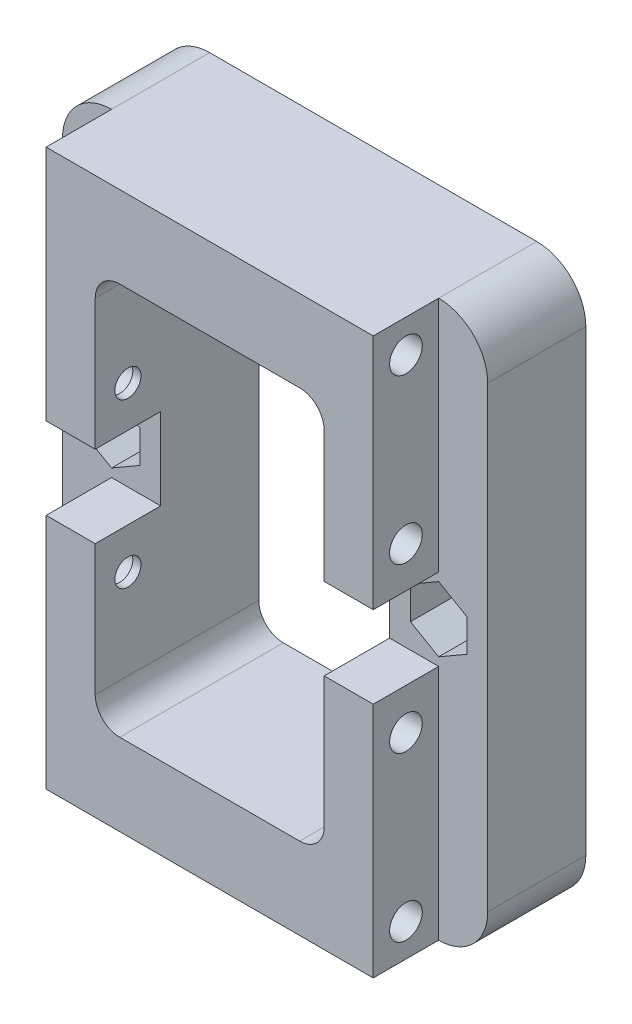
ISO-10303-21;
HEADER;
FILE_DESCRIPTION(('STEP AP214'),'2;1');
FILE_NAME('part.step','',(''),(''),'','','');
FILE_SCHEMA(('AUTOMOTIVE_DESIGN { 1 0 10303 214 1 1 1 1 }'));
ENDSEC;
DATA;
#1=APPLICATION_CONTEXT('core data for automotive mechanical design processes');
#2=APPLICATION_PROTOCOL_DEFINITION('international standard','automotive_design',2000,#1);
#3=PRODUCT_CONTEXT('',#1,'mechanical');
#4=PRODUCT('Part','Part','',(#3));
#5=PRODUCT_RELATED_PRODUCT_CATEGORY('part','',(#4));
#6=PRODUCT_DEFINITION_FORMATION('','',#4);
#7=PRODUCT_DEFINITION_CONTEXT('part definition',#1,'design');
#8=PRODUCT_DEFINITION('design','',#6,#7);
#9=PRODUCT_DEFINITION_SHAPE('','',#8);
#10=(LENGTH_UNIT() NAMED_UNIT(*) SI_UNIT(.MILLI.,.METRE.));
#11=(NAMED_UNIT(*) PLANE_ANGLE_UNIT() SI_UNIT($,.RADIAN.));
#12=(NAMED_UNIT(*) SI_UNIT($,.STERADIAN.) SOLID_ANGLE_UNIT());
#13=UNCERTAINTY_MEASURE_WITH_UNIT(LENGTH_MEASURE(1.E-05),#10,'distance_accuracy_value','');
#14=(GEOMETRIC_REPRESENTATION_CONTEXT(3) GLOBAL_UNCERTAINTY_ASSIGNED_CONTEXT((#13)) GLOBAL_UNIT_ASSIGNED_CONTEXT((#10,
#11,#12)) REPRESENTATION_CONTEXT('',''));
#15=CARTESIAN_POINT('',(0.,0.,0.));
#16=DIRECTION('',(0.,0.,1.));
#17=DIRECTION('',(1.,0.,0.));
#18=AXIS2_PLACEMENT_3D('',#15,#16,#17);
#19=CARTESIAN_POINT('',(26.,-30.,4.));
#20=DIRECTION('',(-1.,0.,0.));
#21=DIRECTION('',(0.,0.,1.));
#22=AXIS2_PLACEMENT_3D('',#19,#20,#21);
#23=CYLINDRICAL_SURFACE('',#22,1.6);
#24=CARTESIAN_POINT('',(-15.,-30.,4.));
#25=DIRECTION('',(-1.,0.,0.));
#26=DIRECTION('',(0.,0.,1.));
#27=AXIS2_PLACEMENT_3D('',#24,#25,#26);
#28=CIRCLE('',#27,1.6);
#29=CARTESIAN_POINT('',(-15.,-30.,5.6));
#30=VERTEX_POINT('',#29);
#31=EDGE_CURVE('E408',#30,#30,#28,.F.);
#32=ORIENTED_EDGE('',*,*,#31,.F.);
#33=EDGE_LOOP('',(#32));
#34=FACE_BOUND('',#33,.T.);
#35=CARTESIAN_POINT('',(15.,-30.,4.));
#36=DIRECTION('',(1.,0.,0.));
#37=DIRECTION('',(0.,0.,-1.));
#38=AXIS2_PLACEMENT_3D('',#35,#36,#37);
#39=CIRCLE('',#38,1.6);
#40=CARTESIAN_POINT('',(15.,-30.,2.4));
#41=VERTEX_POINT('',#40);
#42=EDGE_CURVE('E426',#41,#41,#39,.F.);
#43=ORIENTED_EDGE('',*,*,#42,.F.);
#44=EDGE_LOOP('',(#43));
#45=FACE_BOUND('',#44,.T.);
#46=ADVANCED_FACE('F45',(#34,#45),#23,.F.);
#47=CARTESIAN_POINT('',(26.,30.,3.99999999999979));
#48=DIRECTION('',(-1.,0.,0.));
#49=DIRECTION('',(0.,0.,1.));
#50=AXIS2_PLACEMENT_3D('',#47,#48,#49);
#51=CYLINDRICAL_SURFACE('',#50,1.6);
#52=CARTESIAN_POINT('',(-15.,30.,3.99999999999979));
#53=DIRECTION('',(-1.,0.,0.));
#54=DIRECTION('',(0.,0.,1.));
#55=AXIS2_PLACEMENT_3D('',#52,#53,#54);
#56=CIRCLE('',#55,1.6);
#57=CARTESIAN_POINT('',(-15.,30.,5.59999999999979));
#58=VERTEX_POINT('',#57);
#59=EDGE_CURVE('E399',#58,#58,#56,.F.);
#60=ORIENTED_EDGE('',*,*,#59,.F.);
#61=EDGE_LOOP('',(#60));
#62=FACE_BOUND('',#61,.T.);
#63=CARTESIAN_POINT('',(15.,30.,3.99999999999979));
#64=DIRECTION('',(1.,0.,0.));
#65=DIRECTION('',(0.,0.,-1.));
#66=AXIS2_PLACEMENT_3D('',#63,#64,#65);
#67=CIRCLE('',#66,1.6);
#68=CARTESIAN_POINT('',(15.,30.,2.39999999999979));
#69=VERTEX_POINT('',#68);
#70=EDGE_CURVE('E422',#69,#69,#67,.F.);
#71=ORIENTED_EDGE('',*,*,#70,.F.);
#72=EDGE_LOOP('',(#71));
#73=FACE_BOUND('',#72,.T.);
#74=ADVANCED_FACE('F892',(#62,#73),#51,.F.);
#75=CARTESIAN_POINT('',(26.,-10.,3.99999999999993));
#76=DIRECTION('',(-1.,0.,0.));
#77=DIRECTION('',(0.,0.,1.));
#78=AXIS2_PLACEMENT_3D('',#75,#76,#77);
#79=CYLINDRICAL_SURFACE('',#78,1.6);
#80=CARTESIAN_POINT('',(14.,-10.,3.99999999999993));
#81=DIRECTION('',(1.,0.,0.));
#82=DIRECTION('',(0.,0.,-1.));
#83=AXIS2_PLACEMENT_3D('',#80,#81,#82);
#84=CIRCLE('',#83,1.6);
#85=CARTESIAN_POINT('',(14.,-10.,2.39999999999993));
#86=VERTEX_POINT('',#85);
#87=EDGE_CURVE('E412',#86,#86,#84,.T.);
#88=ORIENTED_EDGE('',*,*,#87,.F.);
#89=EDGE_LOOP('',(#88));
#90=FACE_BOUND('',#89,.T.);
#91=CARTESIAN_POINT('',(15.,-10.,3.99999999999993));
#92=DIRECTION('',(1.,0.,0.));
#93=DIRECTION('',(0.,0.,-1.));
#94=AXIS2_PLACEMENT_3D('',#91,#92,#93);
#95=CIRCLE('',#94,1.6);
#96=CARTESIAN_POINT('',(15.,-10.,2.39999999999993));
#97=VERTEX_POINT('',#96);
#98=EDGE_CURVE('E417',#97,#97,#95,.F.);
#99=ORIENTED_EDGE('',*,*,#98,.F.);
#100=EDGE_LOOP('',(#99));
#101=FACE_BOUND('',#100,.T.);
#102=ADVANCED_FACE('F897',(#90,#101),#79,.F.);
#103=CARTESIAN_POINT('',(26.,10.,3.99999999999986));
#104=DIRECTION('',(-1.,0.,0.));
#105=DIRECTION('',(0.,0.,1.));
#106=AXIS2_PLACEMENT_3D('',#103,#104,#105);
#107=CYLINDRICAL_SURFACE('',#106,1.6);
#108=CARTESIAN_POINT('',(14.,10.,3.99999999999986));
#109=DIRECTION('',(1.,0.,0.));
#110=DIRECTION('',(0.,0.,-1.));
#111=AXIS2_PLACEMENT_3D('',#108,#109,#110);
#112=CIRCLE('',#111,1.6);
#113=CARTESIAN_POINT('',(14.,10.,2.39999999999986));
#114=VERTEX_POINT('',#113);
#115=EDGE_CURVE('E868',#114,#114,#112,.T.);
#116=ORIENTED_EDGE('',*,*,#115,.F.);
#117=EDGE_LOOP('',(#116));
#118=FACE_BOUND('',#117,.T.);
#119=CARTESIAN_POINT('',(15.,10.,3.99999999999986));
#120=DIRECTION('',(1.,0.,0.));
#121=DIRECTION('',(0.,0.,-1.));
#122=AXIS2_PLACEMENT_3D('',#119,#120,#121);
#123=CIRCLE('',#122,1.6);
#124=CARTESIAN_POINT('',(15.,10.,2.39999999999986));
#125=VERTEX_POINT('',#124);
#126=EDGE_CURVE('E413',#125,#125,#123,.F.);
#127=ORIENTED_EDGE('',*,*,#126,.F.);
#128=EDGE_LOOP('',(#127));
#129=FACE_BOUND('',#128,.T.);
#130=ADVANCED_FACE('F910',(#118,#129),#107,.F.);
#131=CARTESIAN_POINT('',(-14.,-10.,3.99999999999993));
#132=DIRECTION('',(-1.,0.,0.));
#133=DIRECTION('',(0.,-1.,0.));
#134=AXIS2_PLACEMENT_3D('',#131,#132,#133);
#135=CIRCLE('',#134,1.6);
#136=CARTESIAN_POINT('',(-14.,-11.6,3.99999999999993));
#137=VERTEX_POINT('',#136);
#138=EDGE_CURVE('E864',#137,#137,#135,.T.);
#139=ORIENTED_EDGE('',*,*,#138,.F.);
#140=EDGE_LOOP('',(#139));
#141=FACE_BOUND('',#140,.T.);
#142=CARTESIAN_POINT('',(-15.,-10.,3.99999999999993));
#143=DIRECTION('',(-1.,0.,0.));
#144=DIRECTION('',(0.,0.,1.));
#145=AXIS2_PLACEMENT_3D('',#142,#143,#144);
#146=CIRCLE('',#145,1.6);
#147=CARTESIAN_POINT('',(-15.,-10.,5.59999999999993));
#148=VERTEX_POINT('',#147);
#149=EDGE_CURVE('E404',#148,#148,#146,.F.);
#150=ORIENTED_EDGE('',*,*,#149,.F.);
#151=EDGE_LOOP('',(#150));
#152=FACE_BOUND('',#151,.T.);
#153=ADVANCED_FACE('F906',(#141,#152),#79,.F.);
#154=CARTESIAN_POINT('',(-14.,10.,3.99999999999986));
#155=DIRECTION('',(-1.,0.,0.));
#156=DIRECTION('',(0.,-1.,0.));
#157=AXIS2_PLACEMENT_3D('',#154,#155,#156);
#158=CIRCLE('',#157,1.6);
#159=CARTESIAN_POINT('',(-14.,8.4,3.99999999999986));
#160=VERTEX_POINT('',#159);
#161=EDGE_CURVE('E872',#160,#160,#158,.T.);
#162=ORIENTED_EDGE('',*,*,#161,.F.);
#163=EDGE_LOOP('',(#162));
#164=FACE_BOUND('',#163,.T.);
#165=CARTESIAN_POINT('',(-15.,10.,3.99999999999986));
#166=DIRECTION('',(-1.,0.,0.));
#167=DIRECTION('',(0.,0.,1.));
#168=AXIS2_PLACEMENT_3D('',#165,#166,#167);
#169=CIRCLE('',#168,1.6);
#170=CARTESIAN_POINT('',(-15.,10.,5.59999999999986));
#171=VERTEX_POINT('',#170);
#172=EDGE_CURVE('E395',#171,#171,#169,.F.);
#173=ORIENTED_EDGE('',*,*,#172,.F.);
#174=EDGE_LOOP('',(#173));
#175=FACE_BOUND('',#174,.T.);
#176=ADVANCED_FACE('F909',(#164,#175),#107,.F.);
#177=CARTESIAN_POINT('',(0.,0.,0.));
#178=DIRECTION('',(0.,0.,-1.));
#179=DIRECTION('',(-1.,0.,0.));
#180=AXIS2_PLACEMENT_3D('',#177,#178,#179);
#181=PLANE('',#180);
#182=DIRECTION('',(-0.866025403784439,-0.499999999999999,0.));
#183=VECTOR('',#182,1.);
#184=CARTESIAN_POINT('',(-20.,3.98371685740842,0.));
#185=LINE('',#184,#183);
#186=CARTESIAN_POINT('',(-20.,3.98371685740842,0.));
#187=VERTEX_POINT('',#186);
#188=CARTESIAN_POINT('',(-23.45,1.99185842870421,0.));
#189=VERTEX_POINT('',#188);
#190=EDGE_CURVE('E635',#187,#189,#185,.T.);
#191=ORIENTED_EDGE('',*,*,#190,.F.);
#192=DIRECTION('',(-0.866025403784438,0.500000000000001,0.));
#193=VECTOR('',#192,1.);
#194=CARTESIAN_POINT('',(-16.55,1.99185842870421,0.));
#195=LINE('',#194,#193);
#196=CARTESIAN_POINT('',(-16.55,1.99185842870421,0.));
#197=VERTEX_POINT('',#196);
#198=EDGE_CURVE('E632',#197,#187,#195,.T.);
#199=ORIENTED_EDGE('',*,*,#198,.F.);
#200=DIRECTION('',(0.,1.,0.));
#201=VECTOR('',#200,1.);
#202=CARTESIAN_POINT('',(-16.55,-1.99185842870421,0.));
#203=LINE('',#202,#201);
#204=CARTESIAN_POINT('',(-16.55,-1.99185842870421,0.));
#205=VERTEX_POINT('',#204);
#206=EDGE_CURVE('E611',#205,#197,#203,.T.);
#207=ORIENTED_EDGE('',*,*,#206,.F.);
#208=DIRECTION('',(0.866025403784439,0.5,0.));
#209=VECTOR('',#208,1.);
#210=CARTESIAN_POINT('',(-20.,-3.98371685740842,0.));
#211=LINE('',#210,#209);
#212=CARTESIAN_POINT('',(-20.,-3.98371685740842,0.));
#213=VERTEX_POINT('',#212);
#214=EDGE_CURVE('E648',#213,#205,#211,.T.);
#215=ORIENTED_EDGE('',*,*,#214,.F.);
#216=DIRECTION('',(0.866025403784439,-0.5,0.));
#217=VECTOR('',#216,1.);
#218=CARTESIAN_POINT('',(-23.45,-1.99185842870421,0.));
#219=LINE('',#218,#217);
#220=CARTESIAN_POINT('',(-23.45,-1.99185842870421,0.));
#221=VERTEX_POINT('',#220);
#222=EDGE_CURVE('E644',#221,#213,#219,.T.);
#223=ORIENTED_EDGE('',*,*,#222,.F.);
#224=DIRECTION('',(0.,-1.,0.));
#225=VECTOR('',#224,1.);
#226=CARTESIAN_POINT('',(-23.45,1.99185842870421,0.));
#227=LINE('',#226,#225);
#228=EDGE_CURVE('E640',#189,#221,#227,.T.);
#229=ORIENTED_EDGE('',*,*,#228,.F.);
#230=EDGE_LOOP('',(#191,#199,#207,#215,#223,#229));
#231=FACE_BOUND('',#230,.T.);
#232=DIRECTION('',(0.,-1.,0.));
#233=VECTOR('',#232,1.);
#234=CARTESIAN_POINT('',(-20.,5.,0.));
#235=LINE('',#234,#233);
#236=CARTESIAN_POINT('',(-20.,34.,0.));
#237=VERTEX_POINT('',#236);
#238=CARTESIAN_POINT('',(-20.,5.,0.));
#239=VERTEX_POINT('',#238);
#240=EDGE_CURVE('E576',#237,#239,#235,.T.);
#241=ORIENTED_EDGE('',*,*,#240,.F.);
#242=CARTESIAN_POINT('',(-20.,28.,0.));
#243=DIRECTION('',(0.,0.,-1.));
#244=DIRECTION('',(-1.,0.,0.));
#245=AXIS2_PLACEMENT_3D('',#242,#243,#244);
#246=CIRCLE('',#245,6.);
#247=CARTESIAN_POINT('',(-26.,28.,0.));
#248=VERTEX_POINT('',#247);
#249=EDGE_CURVE('E69',#237,#248,#246,.F.);
#250=ORIENTED_EDGE('',*,*,#249,.T.);
#251=DIRECTION('',(0.,-1.,0.));
#252=VECTOR('',#251,1.);
#253=CARTESIAN_POINT('',(-26.,-34.,0.));
#254=LINE('',#253,#252);
#255=CARTESIAN_POINT('',(-26.,-28.,0.));
#256=VERTEX_POINT('',#255);
#257=EDGE_CURVE('E369',#248,#256,#254,.T.);
#258=ORIENTED_EDGE('',*,*,#257,.T.);
#259=CARTESIAN_POINT('',(-20.,-28.,0.));
#260=DIRECTION('',(0.,0.,-1.));
#261=DIRECTION('',(-1.,0.,0.));
#262=AXIS2_PLACEMENT_3D('',#259,#260,#261);
#263=CIRCLE('',#262,6.);
#264=CARTESIAN_POINT('',(-20.,-34.,0.));
#265=VERTEX_POINT('',#264);
#266=EDGE_CURVE('E61',#256,#265,#263,.F.);
#267=ORIENTED_EDGE('',*,*,#266,.T.);
#268=DIRECTION('',(0.,-1.,0.));
#269=VECTOR('',#268,1.);
#270=CARTESIAN_POINT('',(-20.,-5.,0.));
#271=LINE('',#270,#269);
#272=CARTESIAN_POINT('',(-20.,-5.,0.));
#273=VERTEX_POINT('',#272);
#274=EDGE_CURVE('E494',#273,#265,#271,.T.);
#275=ORIENTED_EDGE('',*,*,#274,.F.);
#276=DIRECTION('',(-1.,0.,0.));
#277=VECTOR('',#276,1.);
#278=CARTESIAN_POINT('',(-14.,-5.,0.));
#279=LINE('',#278,#277);
#280=CARTESIAN_POINT('',(-14.,-5.,0.));
#281=VERTEX_POINT('',#280);
#282=EDGE_CURVE('E499',#281,#273,#279,.T.);
#283=ORIENTED_EDGE('',*,*,#282,.F.);
#284=DIRECTION('',(0.,-1.,0.));
#285=VECTOR('',#284,1.);
#286=CARTESIAN_POINT('',(-14.,21.,0.));
#287=LINE('',#286,#285);
#288=CARTESIAN_POINT('',(-14.,5.,0.));
#289=VERTEX_POINT('',#288);
#290=EDGE_CURVE('E323',#289,#281,#287,.T.);
#291=ORIENTED_EDGE('',*,*,#290,.F.);
#292=DIRECTION('',(1.,0.,0.));
#293=VECTOR('',#292,1.);
#294=CARTESIAN_POINT('',(-14.,5.,0.));
#295=LINE('',#294,#293);
#296=EDGE_CURVE('E539',#239,#289,#295,.T.);
#297=ORIENTED_EDGE('',*,*,#296,.F.);
#298=EDGE_LOOP('',(#241,#250,#258,#267,#275,#283,#291,#297));
#299=FACE_BOUND('',#298,.T.);
#300=ADVANCED_FACE('F805',(#231,#299),#181,.F.);
#301=DIRECTION('',(-0.866025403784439,-0.499999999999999,0.));
#302=VECTOR('',#301,1.);
#303=CARTESIAN_POINT('',(20.,3.98371685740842,0.));
#304=LINE('',#303,#302);
#305=CARTESIAN_POINT('',(20.,3.98371685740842,0.));
#306=VERTEX_POINT('',#305);
#307=CARTESIAN_POINT('',(16.55,1.99185842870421,0.));
#308=VERTEX_POINT('',#307);
#309=EDGE_CURVE('E707',#306,#308,#304,.T.);
#310=ORIENTED_EDGE('',*,*,#309,.F.);
#311=DIRECTION('',(-0.866025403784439,0.5,0.));
#312=VECTOR('',#311,1.);
#313=CARTESIAN_POINT('',(23.45,1.99185842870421,0.));
#314=LINE('',#313,#312);
#315=CARTESIAN_POINT('',(23.45,1.99185842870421,0.));
#316=VERTEX_POINT('',#315);
#317=EDGE_CURVE('E636',#316,#306,#314,.T.);
#318=ORIENTED_EDGE('',*,*,#317,.F.);
#319=DIRECTION('',(0.,1.,0.));
#320=VECTOR('',#319,1.);
#321=CARTESIAN_POINT('',(23.45,-1.99185842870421,0.));
#322=LINE('',#321,#320);
#323=CARTESIAN_POINT('',(23.45,-1.99185842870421,0.));
#324=VERTEX_POINT('',#323);
#325=EDGE_CURVE('E690',#324,#316,#322,.T.);
#326=ORIENTED_EDGE('',*,*,#325,.F.);
#327=DIRECTION('',(0.866025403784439,0.5,0.));
#328=VECTOR('',#327,1.);
#329=CARTESIAN_POINT('',(20.,-3.98371685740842,0.));
#330=LINE('',#329,#328);
#331=CARTESIAN_POINT('',(20.,-3.98371685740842,0.));
#332=VERTEX_POINT('',#331);
#333=EDGE_CURVE('E694',#332,#324,#330,.T.);
#334=ORIENTED_EDGE('',*,*,#333,.F.);
#335=DIRECTION('',(0.866025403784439,-0.5,0.));
#336=VECTOR('',#335,1.);
#337=CARTESIAN_POINT('',(16.55,-1.99185842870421,0.));
#338=LINE('',#337,#336);
#339=CARTESIAN_POINT('',(16.55,-1.99185842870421,0.));
#340=VERTEX_POINT('',#339);
#341=EDGE_CURVE('E699',#340,#332,#338,.T.);
#342=ORIENTED_EDGE('',*,*,#341,.F.);
#343=DIRECTION('',(0.,-1.,0.));
#344=VECTOR('',#343,1.);
#345=CARTESIAN_POINT('',(16.55,1.99185842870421,0.));
#346=LINE('',#345,#344);
#347=EDGE_CURVE('E703',#308,#340,#346,.T.);
#348=ORIENTED_EDGE('',*,*,#347,.F.);
#349=EDGE_LOOP('',(#310,#318,#326,#334,#342,#348));
#350=FACE_BOUND('',#349,.T.);
#351=DIRECTION('',(0.,1.,0.));
#352=VECTOR('',#351,1.);
#353=CARTESIAN_POINT('',(26.,-34.,0.));
#354=LINE('',#353,#352);
#355=CARTESIAN_POINT('',(26.,-28.,0.));
#356=VERTEX_POINT('',#355);
#357=CARTESIAN_POINT('',(26.,28.,0.));
#358=VERTEX_POINT('',#357);
#359=EDGE_CURVE('E343',#356,#358,#354,.T.);
#360=ORIENTED_EDGE('',*,*,#359,.T.);
#361=CARTESIAN_POINT('',(20.,28.,0.));
#362=DIRECTION('',(0.,0.,-1.));
#363=DIRECTION('',(-1.,0.,0.));
#364=AXIS2_PLACEMENT_3D('',#361,#362,#363);
#365=CIRCLE('',#364,6.);
#366=CARTESIAN_POINT('',(20.,34.,0.));
#367=VERTEX_POINT('',#366);
#368=EDGE_CURVE('E440',#358,#367,#365,.F.);
#369=ORIENTED_EDGE('',*,*,#368,.T.);
#370=DIRECTION('',(0.,1.,0.));
#371=VECTOR('',#370,1.);
#372=CARTESIAN_POINT('',(20.,5.,0.));
#373=LINE('',#372,#371);
#374=CARTESIAN_POINT('',(20.,5.,0.));
#375=VERTEX_POINT('',#374);
#376=EDGE_CURVE('E572',#375,#367,#373,.T.);
#377=ORIENTED_EDGE('',*,*,#376,.F.);
#378=DIRECTION('',(1.,0.,0.));
#379=VECTOR('',#378,1.);
#380=CARTESIAN_POINT('',(14.,5.,0.));
#381=LINE('',#380,#379);
#382=CARTESIAN_POINT('',(14.,5.,0.));
#383=VERTEX_POINT('',#382);
#384=EDGE_CURVE('E320',#383,#375,#381,.T.);
#385=ORIENTED_EDGE('',*,*,#384,.F.);
#386=DIRECTION('',(0.,1.,0.));
#387=VECTOR('',#386,1.);
#388=CARTESIAN_POINT('',(14.,21.,0.));
#389=LINE('',#388,#387);
#390=CARTESIAN_POINT('',(14.,-5.,0.));
#391=VERTEX_POINT('',#390);
#392=EDGE_CURVE('E311',#391,#383,#389,.T.);
#393=ORIENTED_EDGE('',*,*,#392,.F.);
#394=DIRECTION('',(-1.,0.,0.));
#395=VECTOR('',#394,1.);
#396=CARTESIAN_POINT('',(14.,-5.,0.));
#397=LINE('',#396,#395);
#398=CARTESIAN_POINT('',(20.,-5.,0.));
#399=VERTEX_POINT('',#398);
#400=EDGE_CURVE('E293',#399,#391,#397,.T.);
#401=ORIENTED_EDGE('',*,*,#400,.F.);
#402=DIRECTION('',(0.,1.,0.));
#403=VECTOR('',#402,1.);
#404=CARTESIAN_POINT('',(20.,-5.,0.));
#405=LINE('',#404,#403);
#406=CARTESIAN_POINT('',(20.,-34.,0.));
#407=VERTEX_POINT('',#406);
#408=EDGE_CURVE('E305',#407,#399,#405,.T.);
#409=ORIENTED_EDGE('',*,*,#408,.F.);
#410=CARTESIAN_POINT('',(20.,-28.,0.));
#411=DIRECTION('',(0.,0.,-1.));
#412=DIRECTION('',(-1.,0.,0.));
#413=AXIS2_PLACEMENT_3D('',#410,#411,#412);
#414=CIRCLE('',#413,6.);
#415=EDGE_CURVE('E437',#407,#356,#414,.F.);
#416=ORIENTED_EDGE('',*,*,#415,.T.);
#417=EDGE_LOOP('',(#360,#369,#377,#385,#393,#401,#409,#416));
#418=FACE_BOUND('',#417,.T.);
#419=ADVANCED_FACE('F318',(#350,#418),#181,.F.);
#420=CARTESIAN_POINT('',(-20.,0.,-12.));
#421=DIRECTION('',(0.,0.,1.));
#422=DIRECTION('',(1.,0.,0.));
#423=AXIS2_PLACEMENT_3D('',#420,#421,#422);
#424=CYLINDRICAL_SURFACE('',#423,2.1);
#425=CARTESIAN_POINT('',(-20.,0.,-12.));
#426=DIRECTION('',(0.,0.,1.));
#427=DIRECTION('',(1.,0.,0.));
#428=AXIS2_PLACEMENT_3D('',#425,#426,#427);
#429=CIRCLE('',#428,2.1);
#430=CARTESIAN_POINT('',(-17.9,0.,-12.));
#431=VERTEX_POINT('',#430);
#432=EDGE_CURVE('E324',#431,#431,#429,.T.);
#433=ORIENTED_EDGE('',*,*,#432,.F.);
#434=EDGE_LOOP('',(#433));
#435=FACE_BOUND('',#434,.T.);
#436=CARTESIAN_POINT('',(-20.,0.,-6.9));
#437=DIRECTION('',(0.,0.,1.));
#438=DIRECTION('',(1.,0.,0.));
#439=AXIS2_PLACEMENT_3D('',#436,#437,#438);
#440=CIRCLE('',#439,2.1);
#441=CARTESIAN_POINT('',(-17.9,0.,-6.9));
#442=VERTEX_POINT('',#441);
#443=EDGE_CURVE('E390',#442,#442,#440,.F.);
#444=ORIENTED_EDGE('',*,*,#443,.F.);
#445=EDGE_LOOP('',(#444));
#446=FACE_BOUND('',#445,.T.);
#447=ADVANCED_FACE('F1078',(#435,#446),#424,.F.);
#448=CARTESIAN_POINT('',(20.,0.,-12.));
#449=DIRECTION('',(0.,0.,1.));
#450=DIRECTION('',(1.,0.,0.));
#451=AXIS2_PLACEMENT_3D('',#448,#449,#450);
#452=CYLINDRICAL_SURFACE('',#451,2.1);
#453=CARTESIAN_POINT('',(20.,0.,-12.));
#454=DIRECTION('',(0.,0.,1.));
#455=DIRECTION('',(1.,0.,0.));
#456=AXIS2_PLACEMENT_3D('',#453,#454,#455);
#457=CIRCLE('',#456,2.1);
#458=CARTESIAN_POINT('',(22.1,0.,-12.));
#459=VERTEX_POINT('',#458);
#460=EDGE_CURVE('E334',#459,#459,#457,.T.);
#461=ORIENTED_EDGE('',*,*,#460,.F.);
#462=EDGE_LOOP('',(#461));
#463=FACE_BOUND('',#462,.T.);
#464=CARTESIAN_POINT('',(20.,0.,-6.9));
#465=DIRECTION('',(0.,0.,1.));
#466=DIRECTION('',(1.,0.,0.));
#467=AXIS2_PLACEMENT_3D('',#464,#465,#466);
#468=CIRCLE('',#467,2.1);
#469=CARTESIAN_POINT('',(22.1,0.,-6.9));
#470=VERTEX_POINT('',#469);
#471=EDGE_CURVE('E386',#470,#470,#468,.F.);
#472=ORIENTED_EDGE('',*,*,#471,.F.);
#473=EDGE_LOOP('',(#472));
#474=FACE_BOUND('',#473,.T.);
#475=ADVANCED_FACE('F1074',(#463,#474),#452,.F.);
#476=CARTESIAN_POINT('',(26.,-34.,-12.));
#477=DIRECTION('',(1.,0.,0.));
#478=DIRECTION('',(0.,0.,-1.));
#479=AXIS2_PLACEMENT_3D('',#476,#477,#478);
#480=PLANE('',#479);
#481=DIRECTION('',(0.,1.,0.));
#482=VECTOR('',#481,1.);
#483=CARTESIAN_POINT('',(26.,-34.,-12.));
#484=LINE('',#483,#482);
#485=CARTESIAN_POINT('',(26.,-28.,-12.));
#486=VERTEX_POINT('',#485);
#487=CARTESIAN_POINT('',(26.,28.,-12.));
#488=VERTEX_POINT('',#487);
#489=EDGE_CURVE('E365',#486,#488,#484,.T.);
#490=ORIENTED_EDGE('',*,*,#489,.T.);
#491=DIRECTION('',(0.,0.,1.));
#492=VECTOR('',#491,1.);
#493=CARTESIAN_POINT('',(26.,28.,-12.));
#494=LINE('',#493,#492);
#495=EDGE_CURVE('E433',#488,#358,#494,.T.);
#496=ORIENTED_EDGE('',*,*,#495,.T.);
#497=ORIENTED_EDGE('',*,*,#359,.F.);
#498=DIRECTION('',(0.,0.,1.));
#499=VECTOR('',#498,1.);
#500=CARTESIAN_POINT('',(26.,-28.,-12.));
#501=LINE('',#500,#499);
#502=EDGE_CURVE('E381',#356,#486,#501,.F.);
#503=ORIENTED_EDGE('',*,*,#502,.T.);
#504=EDGE_LOOP('',(#490,#496,#497,#503));
#505=FACE_BOUND('',#504,.T.);
#506=ADVANCED_FACE('F1077',(#505),#480,.T.);
#507=CARTESIAN_POINT('',(-26.,-34.,-12.));
#508=DIRECTION('',(0.,-1.,0.));
#509=DIRECTION('',(0.,0.,-1.));
#510=AXIS2_PLACEMENT_3D('',#507,#508,#509);
#511=PLANE('',#510);
#512=DIRECTION('',(0.,0.,-1.));
#513=VECTOR('',#512,1.);
#514=CARTESIAN_POINT('',(-20.,-34.,8.));
#515=LINE('',#514,#513);
#516=CARTESIAN_POINT('',(-20.,-34.,8.));
#517=VERTEX_POINT('',#516);
#518=EDGE_CURVE('E490',#517,#265,#515,.T.);
#519=ORIENTED_EDGE('',*,*,#518,.T.);
#520=DIRECTION('',(0.,0.,1.));
#521=VECTOR('',#520,1.);
#522=CARTESIAN_POINT('',(-20.,-34.,-12.));
#523=LINE('',#522,#521);
#524=CARTESIAN_POINT('',(-20.,-34.,-12.));
#525=VERTEX_POINT('',#524);
#526=EDGE_CURVE('E11',#265,#525,#523,.F.);
#527=ORIENTED_EDGE('',*,*,#526,.T.);
#528=DIRECTION('',(1.,0.,0.));
#529=VECTOR('',#528,1.);
#530=CARTESIAN_POINT('',(-26.,-34.,-12.));
#531=LINE('',#530,#529);
#532=CARTESIAN_POINT('',(20.,-34.,-12.));
#533=VERTEX_POINT('',#532);
#534=EDGE_CURVE('E377',#525,#533,#531,.T.);
#535=ORIENTED_EDGE('',*,*,#534,.T.);
#536=DIRECTION('',(0.,0.,1.));
#537=VECTOR('',#536,1.);
#538=CARTESIAN_POINT('',(20.,-34.,-12.));
#539=LINE('',#538,#537);
#540=EDGE_CURVE('E54',#533,#407,#539,.T.);
#541=ORIENTED_EDGE('',*,*,#540,.T.);
#542=DIRECTION('',(0.,0.,-1.));
#543=VECTOR('',#542,1.);
#544=CARTESIAN_POINT('',(20.,-34.,8.));
#545=LINE('',#544,#543);
#546=CARTESIAN_POINT('',(20.,-34.,8.));
#547=VERTEX_POINT('',#546);
#548=EDGE_CURVE('E481',#547,#407,#545,.T.);
#549=ORIENTED_EDGE('',*,*,#548,.F.);
#550=DIRECTION('',(1.,0.,0.));
#551=VECTOR('',#550,1.);
#552=CARTESIAN_POINT('',(-20.,-34.,8.));
#553=LINE('',#552,#551);
#554=EDGE_CURVE('E511',#517,#547,#553,.T.);
#555=ORIENTED_EDGE('',*,*,#554,.F.);
#556=EDGE_LOOP('',(#519,#527,#535,#541,#549,#555));
#557=FACE_BOUND('',#556,.T.);
#558=ADVANCED_FACE('F479',(#557),#511,.T.);
#559=CARTESIAN_POINT('',(-26.,-34.,-12.));
#560=DIRECTION('',(-1.,0.,0.));
#561=DIRECTION('',(0.,0.,1.));
#562=AXIS2_PLACEMENT_3D('',#559,#560,#561);
#563=PLANE('',#562);
#564=ORIENTED_EDGE('',*,*,#257,.F.);
#565=DIRECTION('',(0.,0.,1.));
#566=VECTOR('',#565,1.);
#567=CARTESIAN_POINT('',(-26.,28.,-12.));
#568=LINE('',#567,#566);
#569=CARTESIAN_POINT('',(-26.,28.,-12.));
#570=VERTEX_POINT('',#569);
#571=EDGE_CURVE('E469',#248,#570,#568,.F.);
#572=ORIENTED_EDGE('',*,*,#571,.T.);
#573=DIRECTION('',(0.,-1.,0.));
#574=VECTOR('',#573,1.);
#575=CARTESIAN_POINT('',(-26.,-34.,-12.));
#576=LINE('',#575,#574);
#577=CARTESIAN_POINT('',(-26.,-28.,-12.));
#578=VERTEX_POINT('',#577);
#579=EDGE_CURVE('E373',#570,#578,#576,.T.);
#580=ORIENTED_EDGE('',*,*,#579,.T.);
#581=DIRECTION('',(0.,0.,1.));
#582=VECTOR('',#581,1.);
#583=CARTESIAN_POINT('',(-26.,-28.,-12.));
#584=LINE('',#583,#582);
#585=EDGE_CURVE('E466',#578,#256,#584,.T.);
#586=ORIENTED_EDGE('',*,*,#585,.T.);
#587=EDGE_LOOP('',(#564,#572,#580,#586));
#588=FACE_BOUND('',#587,.T.);
#589=ADVANCED_FACE('F822',(#588),#563,.T.);
#590=CARTESIAN_POINT('',(-26.,34.,-12.));
#591=DIRECTION('',(0.,1.,0.));
#592=DIRECTION('',(0.,0.,1.));
#593=AXIS2_PLACEMENT_3D('',#590,#591,#592);
#594=PLANE('',#593);
#595=DIRECTION('',(0.,0.,-1.));
#596=VECTOR('',#595,1.);
#597=CARTESIAN_POINT('',(20.,34.,8.));
#598=LINE('',#597,#596);
#599=CARTESIAN_POINT('',(20.,34.,8.));
#600=VERTEX_POINT('',#599);
#601=EDGE_CURVE('E594',#600,#367,#598,.T.);
#602=ORIENTED_EDGE('',*,*,#601,.T.);
#603=DIRECTION('',(0.,0.,1.));
#604=VECTOR('',#603,1.);
#605=CARTESIAN_POINT('',(20.,34.,-12.));
#606=LINE('',#605,#604);
#607=CARTESIAN_POINT('',(20.,34.,-12.));
#608=VERTEX_POINT('',#607);
#609=EDGE_CURVE('E447',#367,#608,#606,.F.);
#610=ORIENTED_EDGE('',*,*,#609,.T.);
#611=DIRECTION('',(-1.,0.,0.));
#612=VECTOR('',#611,1.);
#613=CARTESIAN_POINT('',(-26.,34.,-12.));
#614=LINE('',#613,#612);
#615=CARTESIAN_POINT('',(-20.,34.,-12.));
#616=VERTEX_POINT('',#615);
#617=EDGE_CURVE('E368',#608,#616,#614,.T.);
#618=ORIENTED_EDGE('',*,*,#617,.T.);
#619=DIRECTION('',(0.,0.,1.));
#620=VECTOR('',#619,1.);
#621=CARTESIAN_POINT('',(-20.,34.,-12.));
#622=LINE('',#621,#620);
#623=EDGE_CURVE('E443',#616,#237,#622,.T.);
#624=ORIENTED_EDGE('',*,*,#623,.T.);
#625=DIRECTION('',(0.,0.,-1.));
#626=VECTOR('',#625,1.);
#627=CARTESIAN_POINT('',(-20.,34.,8.));
#628=LINE('',#627,#626);
#629=CARTESIAN_POINT('',(-20.,34.,8.));
#630=VERTEX_POINT('',#629);
#631=EDGE_CURVE('E590',#630,#237,#628,.T.);
#632=ORIENTED_EDGE('',*,*,#631,.F.);
#633=DIRECTION('',(-1.,0.,0.));
#634=VECTOR('',#633,1.);
#635=CARTESIAN_POINT('',(-20.,34.,8.));
#636=LINE('',#635,#634);
#637=EDGE_CURVE('E560',#600,#630,#636,.T.);
#638=ORIENTED_EDGE('',*,*,#637,.F.);
#639=EDGE_LOOP('',(#602,#610,#618,#624,#632,#638));
#640=FACE_BOUND('',#639,.T.);
#641=ADVANCED_FACE('F813',(#640),#594,.T.);
#642=CARTESIAN_POINT('',(0.,0.,-12.));
#643=DIRECTION('',(0.,0.,-1.));
#644=DIRECTION('',(-1.,0.,0.));
#645=AXIS2_PLACEMENT_3D('',#642,#643,#644);
#646=PLANE('',#645);
#647=ORIENTED_EDGE('',*,*,#460,.T.);
#648=EDGE_LOOP('',(#647));
#649=FACE_BOUND('',#648,.T.);
#650=ORIENTED_EDGE('',*,*,#432,.T.);
#651=EDGE_LOOP('',(#650));
#652=FACE_BOUND('',#651,.T.);
#653=CARTESIAN_POINT('',(-11.,-21.,-12.));
#654=DIRECTION('',(0.,0.,1.));
#655=DIRECTION('',(1.,0.,0.));
#656=AXIS2_PLACEMENT_3D('',#653,#654,#655);
#657=CIRCLE('',#656,3.);
#658=CARTESIAN_POINT('',(-14.,-21.,-12.));
#659=VERTEX_POINT('',#658);
#660=CARTESIAN_POINT('',(-11.,-24.,-12.));
#661=VERTEX_POINT('',#660);
#662=EDGE_CURVE('E330',#659,#661,#657,.T.);
#663=ORIENTED_EDGE('',*,*,#662,.T.);
#664=DIRECTION('',(1.,0.,0.));
#665=VECTOR('',#664,1.);
#666=CARTESIAN_POINT('',(-11.,-24.,-12.));
#667=LINE('',#666,#665);
#668=CARTESIAN_POINT('',(11.,-24.,-12.));
#669=VERTEX_POINT('',#668);
#670=EDGE_CURVE('E741',#661,#669,#667,.T.);
#671=ORIENTED_EDGE('',*,*,#670,.T.);
#672=CARTESIAN_POINT('',(11.,-21.,-12.));
#673=DIRECTION('',(0.,0.,1.));
#674=DIRECTION('',(1.,0.,0.));
#675=AXIS2_PLACEMENT_3D('',#672,#673,#674);
#676=CIRCLE('',#675,3.);
#677=CARTESIAN_POINT('',(14.,-21.,-12.));
#678=VERTEX_POINT('',#677);
#679=EDGE_CURVE('E745',#669,#678,#676,.T.);
#680=ORIENTED_EDGE('',*,*,#679,.T.);
#681=DIRECTION('',(0.,1.,0.));
#682=VECTOR('',#681,1.);
#683=CARTESIAN_POINT('',(14.,21.,-12.));
#684=LINE('',#683,#682);
#685=CARTESIAN_POINT('',(14.,21.,-12.));
#686=VERTEX_POINT('',#685);
#687=EDGE_CURVE('E749',#678,#686,#684,.T.);
#688=ORIENTED_EDGE('',*,*,#687,.T.);
#689=CARTESIAN_POINT('',(11.,21.,-12.));
#690=DIRECTION('',(0.,0.,1.));
#691=DIRECTION('',(-1.,0.,0.));
#692=AXIS2_PLACEMENT_3D('',#689,#690,#691);
#693=CIRCLE('',#692,3.);
#694=CARTESIAN_POINT('',(11.,24.,-12.));
#695=VERTEX_POINT('',#694);
#696=EDGE_CURVE('E753',#686,#695,#693,.T.);
#697=ORIENTED_EDGE('',*,*,#696,.T.);
#698=DIRECTION('',(-1.,0.,0.));
#699=VECTOR('',#698,1.);
#700=CARTESIAN_POINT('',(-11.,24.,-12.));
#701=LINE('',#700,#699);
#702=CARTESIAN_POINT('',(-11.,24.,-12.));
#703=VERTEX_POINT('',#702);
#704=EDGE_CURVE('E756',#695,#703,#701,.T.);
#705=ORIENTED_EDGE('',*,*,#704,.T.);
#706=CARTESIAN_POINT('',(-11.,21.,-12.));
#707=DIRECTION('',(0.,0.,1.));
#708=DIRECTION('',(1.,0.,0.));
#709=AXIS2_PLACEMENT_3D('',#706,#707,#708);
#710=CIRCLE('',#709,3.);
#711=CARTESIAN_POINT('',(-14.,21.,-12.));
#712=VERTEX_POINT('',#711);
#713=EDGE_CURVE('E759',#703,#712,#710,.T.);
#714=ORIENTED_EDGE('',*,*,#713,.T.);
#715=DIRECTION('',(0.,-1.,0.));
#716=VECTOR('',#715,1.);
#717=CARTESIAN_POINT('',(-14.,21.,-12.));
#718=LINE('',#717,#716);
#719=EDGE_CURVE('E337',#712,#659,#718,.T.);
#720=ORIENTED_EDGE('',*,*,#719,.T.);
#721=EDGE_LOOP('',(#663,#671,#680,#688,#697,#705,#714,#720));
#722=FACE_BOUND('',#721,.T.);
#723=ORIENTED_EDGE('',*,*,#617,.F.);
#724=CARTESIAN_POINT('',(20.,28.,-12.));
#725=DIRECTION('',(0.,0.,-1.));
#726=DIRECTION('',(-1.,0.,0.));
#727=AXIS2_PLACEMENT_3D('',#724,#725,#726);
#728=CIRCLE('',#727,6.);
#729=EDGE_CURVE('E459',#608,#488,#728,.T.);
#730=ORIENTED_EDGE('',*,*,#729,.T.);
#731=ORIENTED_EDGE('',*,*,#489,.F.);
#732=CARTESIAN_POINT('',(20.,-28.,-12.));
#733=DIRECTION('',(0.,0.,-1.));
#734=DIRECTION('',(-1.,0.,0.));
#735=AXIS2_PLACEMENT_3D('',#732,#733,#734);
#736=CIRCLE('',#735,6.);
#737=EDGE_CURVE('E450',#486,#533,#736,.T.);
#738=ORIENTED_EDGE('',*,*,#737,.T.);
#739=ORIENTED_EDGE('',*,*,#534,.F.);
#740=CARTESIAN_POINT('',(-20.,-28.,-12.));
#741=DIRECTION('',(0.,0.,-1.));
#742=DIRECTION('',(-1.,0.,0.));
#743=AXIS2_PLACEMENT_3D('',#740,#741,#742);
#744=CIRCLE('',#743,6.);
#745=EDGE_CURVE('E453',#525,#578,#744,.T.);
#746=ORIENTED_EDGE('',*,*,#745,.T.);
#747=ORIENTED_EDGE('',*,*,#579,.F.);
#748=CARTESIAN_POINT('',(-20.,28.,-12.));
#749=DIRECTION('',(0.,0.,-1.));
#750=DIRECTION('',(-1.,0.,0.));
#751=AXIS2_PLACEMENT_3D('',#748,#749,#750);
#752=CIRCLE('',#751,6.);
#753=EDGE_CURVE('E456',#570,#616,#752,.T.);
#754=ORIENTED_EDGE('',*,*,#753,.T.);
#755=EDGE_LOOP('',(#723,#730,#731,#738,#739,#746,#747,#754));
#756=FACE_BOUND('',#755,.T.);
#757=ADVANCED_FACE('F766',(#649,#652,#722,#756),#646,.T.);
#758=CARTESIAN_POINT('',(-11.,-21.,-12.));
#759=DIRECTION('',(0.,0.,1.));
#760=DIRECTION('',(1.,0.,0.));
#761=AXIS2_PLACEMENT_3D('',#758,#759,#760);
#762=CYLINDRICAL_SURFACE('',#761,3.);
#763=DIRECTION('',(0.,0.,1.));
#764=VECTOR('',#763,1.);
#765=CARTESIAN_POINT('',(-14.,-21.,-12.));
#766=LINE('',#765,#764);
#767=CARTESIAN_POINT('',(-14.,-21.,8.));
#768=VERTEX_POINT('',#767);
#769=EDGE_CURVE('E340',#659,#768,#766,.T.);
#770=ORIENTED_EDGE('',*,*,#769,.T.);
#771=CARTESIAN_POINT('',(-11.,-21.,8.));
#772=DIRECTION('',(0.,0.,-1.));
#773=DIRECTION('',(1.,0.,0.));
#774=AXIS2_PLACEMENT_3D('',#771,#772,#773);
#775=CIRCLE('',#774,3.);
#776=CARTESIAN_POINT('',(-11.,-24.,8.));
#777=VERTEX_POINT('',#776);
#778=EDGE_CURVE('E523',#777,#768,#775,.T.);
#779=ORIENTED_EDGE('',*,*,#778,.F.);
#780=DIRECTION('',(0.,0.,1.));
#781=VECTOR('',#780,1.);
#782=CARTESIAN_POINT('',(-11.,-24.,-12.));
#783=LINE('',#782,#781);
#784=EDGE_CURVE('E362',#661,#777,#783,.T.);
#785=ORIENTED_EDGE('',*,*,#784,.F.);
#786=ORIENTED_EDGE('',*,*,#662,.F.);
#787=EDGE_LOOP('',(#770,#779,#785,#786));
#788=FACE_BOUND('',#787,.T.);
#789=ADVANCED_FACE('F777',(#788),#762,.F.);
#790=CARTESIAN_POINT('',(-14.,21.,-12.));
#791=DIRECTION('',(-1.,0.,0.));
#792=DIRECTION('',(0.,-1.,0.));
#793=AXIS2_PLACEMENT_3D('',#790,#791,#792);
#794=PLANE('',#793);
#795=ORIENTED_EDGE('',*,*,#138,.T.);
#796=EDGE_LOOP('',(#795));
#797=FACE_BOUND('',#796,.T.);
#798=ORIENTED_EDGE('',*,*,#161,.T.);
#799=EDGE_LOOP('',(#798));
#800=FACE_BOUND('',#799,.T.);
#801=DIRECTION('',(0.,0.,1.));
#802=VECTOR('',#801,1.);
#803=CARTESIAN_POINT('',(-14.,21.,-12.));
#804=LINE('',#803,#802);
#805=CARTESIAN_POINT('',(-14.,21.,8.));
#806=VERTEX_POINT('',#805);
#807=EDGE_CURVE('E344',#712,#806,#804,.T.);
#808=ORIENTED_EDGE('',*,*,#807,.T.);
#809=DIRECTION('',(0.,1.,0.));
#810=VECTOR('',#809,1.);
#811=CARTESIAN_POINT('',(-14.,21.,8.));
#812=LINE('',#811,#810);
#813=CARTESIAN_POINT('',(-14.,5.,8.));
#814=VERTEX_POINT('',#813);
#815=EDGE_CURVE('E534',#814,#806,#812,.T.);
#816=ORIENTED_EDGE('',*,*,#815,.F.);
#817=DIRECTION('',(0.,0.,-1.));
#818=VECTOR('',#817,1.);
#819=CARTESIAN_POINT('',(-14.,5.,8.));
#820=LINE('',#819,#818);
#821=EDGE_CURVE('E569',#814,#289,#820,.T.);
#822=ORIENTED_EDGE('',*,*,#821,.T.);
#823=ORIENTED_EDGE('',*,*,#290,.T.);
#824=DIRECTION('',(0.,0.,-1.));
#825=VECTOR('',#824,1.);
#826=CARTESIAN_POINT('',(-14.,-5.,8.));
#827=LINE('',#826,#825);
#828=CARTESIAN_POINT('',(-14.,-5.,8.));
#829=VERTEX_POINT('',#828);
#830=EDGE_CURVE('E836',#829,#281,#827,.T.);
#831=ORIENTED_EDGE('',*,*,#830,.F.);
#832=DIRECTION('',(0.,1.,0.));
#833=VECTOR('',#832,1.);
#834=CARTESIAN_POINT('',(-14.,-21.,8.));
#835=LINE('',#834,#833);
#836=EDGE_CURVE('E520',#768,#829,#835,.T.);
#837=ORIENTED_EDGE('',*,*,#836,.F.);
#838=ORIENTED_EDGE('',*,*,#769,.F.);
#839=ORIENTED_EDGE('',*,*,#719,.F.);
#840=EDGE_LOOP('',(#808,#816,#822,#823,#831,#837,#838,#839));
#841=FACE_BOUND('',#840,.T.);
#842=ADVANCED_FACE('F770',(#797,#800,#841),#794,.F.);
#843=CARTESIAN_POINT('',(-11.,21.,-12.));
#844=DIRECTION('',(0.,0.,1.));
#845=DIRECTION('',(1.,0.,0.));
#846=AXIS2_PLACEMENT_3D('',#843,#844,#845);
#847=CYLINDRICAL_SURFACE('',#846,3.);
#848=DIRECTION('',(0.,0.,1.));
#849=VECTOR('',#848,1.);
#850=CARTESIAN_POINT('',(-11.,24.,-12.));
#851=LINE('',#850,#849);
#852=CARTESIAN_POINT('',(-11.,24.,8.));
#853=VERTEX_POINT('',#852);
#854=EDGE_CURVE('E347',#703,#853,#851,.T.);
#855=ORIENTED_EDGE('',*,*,#854,.T.);
#856=CARTESIAN_POINT('',(-11.,21.,8.));
#857=DIRECTION('',(0.,0.,-1.));
#858=DIRECTION('',(1.,0.,0.));
#859=AXIS2_PLACEMENT_3D('',#856,#857,#858);
#860=CIRCLE('',#859,3.);
#861=EDGE_CURVE('E538',#806,#853,#860,.T.);
#862=ORIENTED_EDGE('',*,*,#861,.F.);
#863=ORIENTED_EDGE('',*,*,#807,.F.);
#864=ORIENTED_EDGE('',*,*,#713,.F.);
#865=EDGE_LOOP('',(#855,#862,#863,#864));
#866=FACE_BOUND('',#865,.T.);
#867=ADVANCED_FACE('F797',(#866),#847,.F.);
#868=CARTESIAN_POINT('',(-11.,24.,-12.));
#869=DIRECTION('',(0.,1.,0.));
#870=DIRECTION('',(0.,0.,1.));
#871=AXIS2_PLACEMENT_3D('',#868,#869,#870);
#872=PLANE('',#871);
#873=DIRECTION('',(0.,0.,1.));
#874=VECTOR('',#873,1.);
#875=CARTESIAN_POINT('',(11.,24.,-12.));
#876=LINE('',#875,#874);
#877=CARTESIAN_POINT('',(11.,24.,8.));
#878=VERTEX_POINT('',#877);
#879=EDGE_CURVE('E350',#695,#878,#876,.T.);
#880=ORIENTED_EDGE('',*,*,#879,.T.);
#881=DIRECTION('',(1.,0.,0.));
#882=VECTOR('',#881,1.);
#883=CARTESIAN_POINT('',(11.,24.,8.));
#884=LINE('',#883,#882);
#885=EDGE_CURVE('E543',#853,#878,#884,.T.);
#886=ORIENTED_EDGE('',*,*,#885,.F.);
#887=ORIENTED_EDGE('',*,*,#854,.F.);
#888=ORIENTED_EDGE('',*,*,#704,.F.);
#889=EDGE_LOOP('',(#880,#886,#887,#888));
#890=FACE_BOUND('',#889,.T.);
#891=ADVANCED_FACE('F794',(#890),#872,.F.);
#892=CARTESIAN_POINT('',(11.,21.,-12.));
#893=DIRECTION('',(0.,0.,1.));
#894=DIRECTION('',(1.,0.,0.));
#895=AXIS2_PLACEMENT_3D('',#892,#893,#894);
#896=CYLINDRICAL_SURFACE('',#895,3.);
#897=DIRECTION('',(0.,0.,1.));
#898=VECTOR('',#897,1.);
#899=CARTESIAN_POINT('',(14.,21.,-12.));
#900=LINE('',#899,#898);
#901=CARTESIAN_POINT('',(14.,21.,8.));
#902=VERTEX_POINT('',#901);
#903=EDGE_CURVE('E353',#686,#902,#900,.T.);
#904=ORIENTED_EDGE('',*,*,#903,.T.);
#905=CARTESIAN_POINT('',(11.,21.,8.));
#906=DIRECTION('',(0.,0.,-1.));
#907=DIRECTION('',(1.,0.,0.));
#908=AXIS2_PLACEMENT_3D('',#905,#906,#907);
#909=CIRCLE('',#908,3.);
#910=EDGE_CURVE('E547',#878,#902,#909,.T.);
#911=ORIENTED_EDGE('',*,*,#910,.F.);
#912=ORIENTED_EDGE('',*,*,#879,.F.);
#913=ORIENTED_EDGE('',*,*,#696,.F.);
#914=EDGE_LOOP('',(#904,#911,#912,#913));
#915=FACE_BOUND('',#914,.T.);
#916=ADVANCED_FACE('F791',(#915),#896,.F.);
#917=CARTESIAN_POINT('',(14.,21.,-12.));
#918=DIRECTION('',(1.,0.,0.));
#919=DIRECTION('',(0.,0.,-1.));
#920=AXIS2_PLACEMENT_3D('',#917,#918,#919);
#921=PLANE('',#920);
#922=ORIENTED_EDGE('',*,*,#87,.T.);
#923=EDGE_LOOP('',(#922));
#924=FACE_BOUND('',#923,.T.);
#925=ORIENTED_EDGE('',*,*,#115,.T.);
#926=EDGE_LOOP('',(#925));
#927=FACE_BOUND('',#926,.T.);
#928=DIRECTION('',(0.,0.,1.));
#929=VECTOR('',#928,1.);
#930=CARTESIAN_POINT('',(14.,-21.,-12.));
#931=LINE('',#930,#929);
#932=CARTESIAN_POINT('',(14.,-21.,8.));
#933=VERTEX_POINT('',#932);
#934=EDGE_CURVE('E356',#678,#933,#931,.T.);
#935=ORIENTED_EDGE('',*,*,#934,.T.);
#936=DIRECTION('',(0.,-1.,0.));
#937=VECTOR('',#936,1.);
#938=CARTESIAN_POINT('',(14.,-5.,8.));
#939=LINE('',#938,#937);
#940=CARTESIAN_POINT('',(14.,-5.,8.));
#941=VERTEX_POINT('',#940);
#942=EDGE_CURVE('E314',#941,#933,#939,.T.);
#943=ORIENTED_EDGE('',*,*,#942,.F.);
#944=DIRECTION('',(0.,0.,-1.));
#945=VECTOR('',#944,1.);
#946=CARTESIAN_POINT('',(14.,-5.,8.));
#947=LINE('',#946,#945);
#948=EDGE_CURVE('E297',#941,#391,#947,.T.);
#949=ORIENTED_EDGE('',*,*,#948,.T.);
#950=ORIENTED_EDGE('',*,*,#392,.T.);
#951=DIRECTION('',(0.,0.,-1.));
#952=VECTOR('',#951,1.);
#953=CARTESIAN_POINT('',(14.,5.,8.));
#954=LINE('',#953,#952);
#955=CARTESIAN_POINT('',(14.,5.,8.));
#956=VERTEX_POINT('',#955);
#957=EDGE_CURVE('E602',#956,#383,#954,.T.);
#958=ORIENTED_EDGE('',*,*,#957,.F.);
#959=DIRECTION('',(0.,-1.,0.));
#960=VECTOR('',#959,1.);
#961=CARTESIAN_POINT('',(14.,21.,8.));
#962=LINE('',#961,#960);
#963=EDGE_CURVE('E551',#902,#956,#962,.T.);
#964=ORIENTED_EDGE('',*,*,#963,.F.);
#965=ORIENTED_EDGE('',*,*,#903,.F.);
#966=ORIENTED_EDGE('',*,*,#687,.F.);
#967=EDGE_LOOP('',(#935,#943,#949,#950,#958,#964,#965,#966));
#968=FACE_BOUND('',#967,.T.);
#969=ADVANCED_FACE('F309',(#924,#927,#968),#921,.F.);
#970=CARTESIAN_POINT('',(11.,-21.,-12.));
#971=DIRECTION('',(0.,0.,1.));
#972=DIRECTION('',(1.,0.,0.));
#973=AXIS2_PLACEMENT_3D('',#970,#971,#972);
#974=CYLINDRICAL_SURFACE('',#973,3.);
#975=DIRECTION('',(0.,0.,1.));
#976=VECTOR('',#975,1.);
#977=CARTESIAN_POINT('',(11.,-24.,-12.));
#978=LINE('',#977,#976);
#979=CARTESIAN_POINT('',(11.,-24.,8.));
#980=VERTEX_POINT('',#979);
#981=EDGE_CURVE('E359',#669,#980,#978,.T.);
#982=ORIENTED_EDGE('',*,*,#981,.T.);
#983=CARTESIAN_POINT('',(11.,-21.,8.));
#984=DIRECTION('',(0.,0.,-1.));
#985=DIRECTION('',(1.,0.,0.));
#986=AXIS2_PLACEMENT_3D('',#983,#984,#985);
#987=CIRCLE('',#986,3.);
#988=EDGE_CURVE('E306',#933,#980,#987,.T.);
#989=ORIENTED_EDGE('',*,*,#988,.F.);
#990=ORIENTED_EDGE('',*,*,#934,.F.);
#991=ORIENTED_EDGE('',*,*,#679,.F.);
#992=EDGE_LOOP('',(#982,#989,#990,#991));
#993=FACE_BOUND('',#992,.T.);
#994=ADVANCED_FACE('F785',(#993),#974,.F.);
#995=CARTESIAN_POINT('',(-11.,-24.,-12.));
#996=DIRECTION('',(0.,-1.,0.));
#997=DIRECTION('',(0.,0.,-1.));
#998=AXIS2_PLACEMENT_3D('',#995,#996,#997);
#999=PLANE('',#998);
#1000=ORIENTED_EDGE('',*,*,#784,.T.);
#1001=DIRECTION('',(-1.,0.,0.));
#1002=VECTOR('',#1001,1.);
#1003=CARTESIAN_POINT('',(-11.,-24.,8.));
#1004=LINE('',#1003,#1002);
#1005=EDGE_CURVE('E527',#980,#777,#1004,.T.);
#1006=ORIENTED_EDGE('',*,*,#1005,.F.);
#1007=ORIENTED_EDGE('',*,*,#981,.F.);
#1008=ORIENTED_EDGE('',*,*,#670,.F.);
#1009=EDGE_LOOP('',(#1000,#1006,#1007,#1008));
#1010=FACE_BOUND('',#1009,.T.);
#1011=ADVANCED_FACE('F782',(#1010),#999,.F.);
#1012=CARTESIAN_POINT('',(0.,0.,-6.9));
#1013=DIRECTION('',(0.,0.,1.));
#1014=DIRECTION('',(1.,0.,0.));
#1015=AXIS2_PLACEMENT_3D('',#1012,#1013,#1014);
#1016=PLANE('',#1015);
#1017=DIRECTION('',(-0.866025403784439,0.5,0.));
#1018=VECTOR('',#1017,1.);
#1019=CARTESIAN_POINT('',(23.45,1.99185842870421,-6.9));
#1020=LINE('',#1019,#1018);
#1021=CARTESIAN_POINT('',(23.45,1.99185842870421,-6.9));
#1022=VERTEX_POINT('',#1021);
#1023=CARTESIAN_POINT('',(20.,3.98371685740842,-6.9));
#1024=VERTEX_POINT('',#1023);
#1025=EDGE_CURVE('E695',#1022,#1024,#1020,.T.);
#1026=ORIENTED_EDGE('',*,*,#1025,.T.);
#1027=DIRECTION('',(-0.866025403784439,-0.499999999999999,0.));
#1028=VECTOR('',#1027,1.);
#1029=CARTESIAN_POINT('',(20.,3.98371685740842,-6.9));
#1030=LINE('',#1029,#1028);
#1031=CARTESIAN_POINT('',(16.55,1.99185842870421,-6.9));
#1032=VERTEX_POINT('',#1031);
#1033=EDGE_CURVE('E728',#1024,#1032,#1030,.T.);
#1034=ORIENTED_EDGE('',*,*,#1033,.T.);
#1035=DIRECTION('',(0.,-1.,0.));
#1036=VECTOR('',#1035,1.);
#1037=CARTESIAN_POINT('',(16.55,1.99185842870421,-6.9));
#1038=LINE('',#1037,#1036);
#1039=CARTESIAN_POINT('',(16.55,-1.99185842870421,-6.9));
#1040=VERTEX_POINT('',#1039);
#1041=EDGE_CURVE('E724',#1032,#1040,#1038,.T.);
#1042=ORIENTED_EDGE('',*,*,#1041,.T.);
#1043=DIRECTION('',(0.866025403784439,-0.5,0.));
#1044=VECTOR('',#1043,1.);
#1045=CARTESIAN_POINT('',(16.55,-1.99185842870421,-6.9));
#1046=LINE('',#1045,#1044);
#1047=CARTESIAN_POINT('',(20.,-3.98371685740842,-6.9));
#1048=VERTEX_POINT('',#1047);
#1049=EDGE_CURVE('E720',#1040,#1048,#1046,.T.);
#1050=ORIENTED_EDGE('',*,*,#1049,.T.);
#1051=DIRECTION('',(0.866025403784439,0.5,0.));
#1052=VECTOR('',#1051,1.);
#1053=CARTESIAN_POINT('',(20.,-3.98371685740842,-6.9));
#1054=LINE('',#1053,#1052);
#1055=CARTESIAN_POINT('',(23.45,-1.99185842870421,-6.9));
#1056=VERTEX_POINT('',#1055);
#1057=EDGE_CURVE('E716',#1048,#1056,#1054,.T.);
#1058=ORIENTED_EDGE('',*,*,#1057,.T.);
#1059=DIRECTION('',(0.,1.,0.));
#1060=VECTOR('',#1059,1.);
#1061=CARTESIAN_POINT('',(23.45,-1.99185842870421,-6.9));
#1062=LINE('',#1061,#1060);
#1063=EDGE_CURVE('E675',#1056,#1022,#1062,.T.);
#1064=ORIENTED_EDGE('',*,*,#1063,.T.);
#1065=EDGE_LOOP('',(#1026,#1034,#1042,#1050,#1058,#1064));
#1066=FACE_BOUND('',#1065,.T.);
#1067=ORIENTED_EDGE('',*,*,#471,.T.);
#1068=EDGE_LOOP('',(#1067));
#1069=FACE_BOUND('',#1068,.T.);
#1070=ADVANCED_FACE('F1051',(#1066,#1069),#1016,.T.);
#1071=CARTESIAN_POINT('',(23.45,1.99185842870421,-6.9));
#1072=DIRECTION('',(0.5,0.866025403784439,0.));
#1073=DIRECTION('',(-0.866025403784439,0.5,0.));
#1074=AXIS2_PLACEMENT_3D('',#1071,#1072,#1073);
#1075=PLANE('',#1074);
#1076=ORIENTED_EDGE('',*,*,#317,.T.);
#1077=DIRECTION('',(0.,0.,1.));
#1078=VECTOR('',#1077,1.);
#1079=CARTESIAN_POINT('',(20.,3.98371685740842,-6.9));
#1080=LINE('',#1079,#1078);
#1081=EDGE_CURVE('E671',#1024,#306,#1080,.T.);
#1082=ORIENTED_EDGE('',*,*,#1081,.F.);
#1083=ORIENTED_EDGE('',*,*,#1025,.F.);
#1084=DIRECTION('',(0.,0.,1.));
#1085=VECTOR('',#1084,1.);
#1086=CARTESIAN_POINT('',(23.45,1.99185842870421,-6.9));
#1087=LINE('',#1086,#1085);
#1088=EDGE_CURVE('E605',#1022,#316,#1087,.T.);
#1089=ORIENTED_EDGE('',*,*,#1088,.T.);
#1090=EDGE_LOOP('',(#1076,#1082,#1083,#1089));
#1091=FACE_BOUND('',#1090,.T.);
#1092=ADVANCED_FACE('F1047',(#1091),#1075,.F.);
#1093=CARTESIAN_POINT('',(23.45,-1.99185842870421,-6.9));
#1094=DIRECTION('',(1.,0.,0.));
#1095=DIRECTION('',(0.,0.,-1.));
#1096=AXIS2_PLACEMENT_3D('',#1093,#1094,#1095);
#1097=PLANE('',#1096);
#1098=ORIENTED_EDGE('',*,*,#325,.T.);
#1099=ORIENTED_EDGE('',*,*,#1088,.F.);
#1100=ORIENTED_EDGE('',*,*,#1063,.F.);
#1101=DIRECTION('',(0.,0.,1.));
#1102=VECTOR('',#1101,1.);
#1103=CARTESIAN_POINT('',(23.45,-1.99185842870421,-6.9));
#1104=LINE('',#1103,#1102);
#1105=EDGE_CURVE('E685',#1056,#324,#1104,.T.);
#1106=ORIENTED_EDGE('',*,*,#1105,.T.);
#1107=EDGE_LOOP('',(#1098,#1099,#1100,#1106));
#1108=FACE_BOUND('',#1107,.T.);
#1109=ADVANCED_FACE('F1050',(#1108),#1097,.F.);
#1110=CARTESIAN_POINT('',(20.,-3.98371685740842,-6.9));
#1111=DIRECTION('',(0.5,-0.866025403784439,0.));
#1112=DIRECTION('',(0.866025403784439,0.5,0.));
#1113=AXIS2_PLACEMENT_3D('',#1110,#1111,#1112);
#1114=PLANE('',#1113);
#1115=ORIENTED_EDGE('',*,*,#333,.T.);
#1116=ORIENTED_EDGE('',*,*,#1105,.F.);
#1117=ORIENTED_EDGE('',*,*,#1057,.F.);
#1118=DIRECTION('',(0.,0.,1.));
#1119=VECTOR('',#1118,1.);
#1120=CARTESIAN_POINT('',(20.,-3.98371685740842,-6.9));
#1121=LINE('',#1120,#1119);
#1122=EDGE_CURVE('E682',#1048,#332,#1121,.T.);
#1123=ORIENTED_EDGE('',*,*,#1122,.T.);
#1124=EDGE_LOOP('',(#1115,#1116,#1117,#1123));
#1125=FACE_BOUND('',#1124,.T.);
#1126=ADVANCED_FACE('F1063',(#1125),#1114,.F.);
#1127=CARTESIAN_POINT('',(16.55,-1.99185842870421,-6.9));
#1128=DIRECTION('',(-0.5,-0.866025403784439,0.));
#1129=DIRECTION('',(0.866025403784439,-0.5,0.));
#1130=AXIS2_PLACEMENT_3D('',#1127,#1128,#1129);
#1131=PLANE('',#1130);
#1132=ORIENTED_EDGE('',*,*,#341,.T.);
#1133=ORIENTED_EDGE('',*,*,#1122,.F.);
#1134=ORIENTED_EDGE('',*,*,#1049,.F.);
#1135=DIRECTION('',(0.,0.,1.));
#1136=VECTOR('',#1135,1.);
#1137=CARTESIAN_POINT('',(16.55,-1.99185842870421,-6.9));
#1138=LINE('',#1137,#1136);
#1139=EDGE_CURVE('E679',#1040,#340,#1138,.T.);
#1140=ORIENTED_EDGE('',*,*,#1139,.T.);
#1141=EDGE_LOOP('',(#1132,#1133,#1134,#1140));
#1142=FACE_BOUND('',#1141,.T.);
#1143=ADVANCED_FACE('F1059',(#1142),#1131,.F.);
#1144=CARTESIAN_POINT('',(16.55,1.99185842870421,-6.9));
#1145=DIRECTION('',(-1.,0.,0.));
#1146=DIRECTION('',(0.,0.,1.));
#1147=AXIS2_PLACEMENT_3D('',#1144,#1145,#1146);
#1148=PLANE('',#1147);
#1149=ORIENTED_EDGE('',*,*,#347,.T.);
#1150=ORIENTED_EDGE('',*,*,#1139,.F.);
#1151=ORIENTED_EDGE('',*,*,#1041,.F.);
#1152=DIRECTION('',(0.,0.,1.));
#1153=VECTOR('',#1152,1.);
#1154=CARTESIAN_POINT('',(16.55,1.99185842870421,-6.9));
#1155=LINE('',#1154,#1153);
#1156=EDGE_CURVE('E676',#1032,#308,#1155,.T.);
#1157=ORIENTED_EDGE('',*,*,#1156,.T.);
#1158=EDGE_LOOP('',(#1149,#1150,#1151,#1157));
#1159=FACE_BOUND('',#1158,.T.);
#1160=ADVANCED_FACE('F1055',(#1159),#1148,.F.);
#1161=CARTESIAN_POINT('',(20.,3.98371685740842,-6.9));
#1162=DIRECTION('',(-0.499999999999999,0.866025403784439,0.));
#1163=DIRECTION('',(-0.866025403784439,-0.499999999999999,0.));
#1164=AXIS2_PLACEMENT_3D('',#1161,#1162,#1163);
#1165=PLANE('',#1164);
#1166=ORIENTED_EDGE('',*,*,#309,.T.);
#1167=ORIENTED_EDGE('',*,*,#1156,.F.);
#1168=ORIENTED_EDGE('',*,*,#1033,.F.);
#1169=ORIENTED_EDGE('',*,*,#1081,.T.);
#1170=EDGE_LOOP('',(#1166,#1167,#1168,#1169));
#1171=FACE_BOUND('',#1170,.T.);
#1172=ADVANCED_FACE('F1023',(#1171),#1165,.F.);
#1173=CARTESIAN_POINT('',(0.,0.,-6.9));
#1174=DIRECTION('',(0.,0.,1.));
#1175=DIRECTION('',(1.,0.,0.));
#1176=AXIS2_PLACEMENT_3D('',#1173,#1174,#1175);
#1177=PLANE('',#1176);
#1178=DIRECTION('',(-0.866025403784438,0.500000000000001,0.));
#1179=VECTOR('',#1178,1.);
#1180=CARTESIAN_POINT('',(-16.55,1.99185842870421,-6.9));
#1181=LINE('',#1180,#1179);
#1182=CARTESIAN_POINT('',(-16.55,1.99185842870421,-6.9));
#1183=VERTEX_POINT('',#1182);
#1184=CARTESIAN_POINT('',(-20.,3.98371685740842,-6.9));
#1185=VERTEX_POINT('',#1184);
#1186=EDGE_CURVE('E606',#1183,#1185,#1181,.T.);
#1187=ORIENTED_EDGE('',*,*,#1186,.T.);
#1188=DIRECTION('',(-0.866025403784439,-0.499999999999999,0.));
#1189=VECTOR('',#1188,1.);
#1190=CARTESIAN_POINT('',(-20.,3.98371685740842,-6.9));
#1191=LINE('',#1190,#1189);
#1192=CARTESIAN_POINT('',(-23.45,1.99185842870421,-6.9));
#1193=VERTEX_POINT('',#1192);
#1194=EDGE_CURVE('E610',#1185,#1193,#1191,.T.);
#1195=ORIENTED_EDGE('',*,*,#1194,.T.);
#1196=DIRECTION('',(0.,-1.,0.));
#1197=VECTOR('',#1196,1.);
#1198=CARTESIAN_POINT('',(-23.45,1.99185842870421,-6.9));
#1199=LINE('',#1198,#1197);
#1200=CARTESIAN_POINT('',(-23.45,-1.99185842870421,-6.9));
#1201=VERTEX_POINT('',#1200);
#1202=EDGE_CURVE('E615',#1193,#1201,#1199,.T.);
#1203=ORIENTED_EDGE('',*,*,#1202,.T.);
#1204=DIRECTION('',(0.866025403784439,-0.5,0.));
#1205=VECTOR('',#1204,1.);
#1206=CARTESIAN_POINT('',(-23.45,-1.99185842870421,-6.9));
#1207=LINE('',#1206,#1205);
#1208=CARTESIAN_POINT('',(-20.,-3.98371685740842,-6.9));
#1209=VERTEX_POINT('',#1208);
#1210=EDGE_CURVE('E619',#1201,#1209,#1207,.T.);
#1211=ORIENTED_EDGE('',*,*,#1210,.T.);
#1212=DIRECTION('',(0.866025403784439,0.5,0.));
#1213=VECTOR('',#1212,1.);
#1214=CARTESIAN_POINT('',(-20.,-3.98371685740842,-6.9));
#1215=LINE('',#1214,#1213);
#1216=CARTESIAN_POINT('',(-16.55,-1.99185842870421,-6.9));
#1217=VERTEX_POINT('',#1216);
#1218=EDGE_CURVE('E623',#1209,#1217,#1215,.T.);
#1219=ORIENTED_EDGE('',*,*,#1218,.T.);
#1220=DIRECTION('',(0.,1.,0.));
#1221=VECTOR('',#1220,1.);
#1222=CARTESIAN_POINT('',(-16.55,-1.99185842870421,-6.9));
#1223=LINE('',#1222,#1221);
#1224=EDGE_CURVE('E627',#1217,#1183,#1223,.T.);
#1225=ORIENTED_EDGE('',*,*,#1224,.T.);
#1226=EDGE_LOOP('',(#1187,#1195,#1203,#1211,#1219,#1225));
#1227=FACE_BOUND('',#1226,.T.);
#1228=ORIENTED_EDGE('',*,*,#443,.T.);
#1229=EDGE_LOOP('',(#1228));
#1230=FACE_BOUND('',#1229,.T.);
#1231=ADVANCED_FACE('F1019',(#1227,#1230),#1177,.T.);
#1232=CARTESIAN_POINT('',(-16.55,1.99185842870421,-6.9));
#1233=DIRECTION('',(0.500000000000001,0.866025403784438,0.));
#1234=DIRECTION('',(-0.866025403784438,0.500000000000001,0.));
#1235=AXIS2_PLACEMENT_3D('',#1232,#1233,#1234);
#1236=PLANE('',#1235);
#1237=ORIENTED_EDGE('',*,*,#198,.T.);
#1238=DIRECTION('',(0.,0.,1.));
#1239=VECTOR('',#1238,1.);
#1240=CARTESIAN_POINT('',(-20.,3.98371685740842,-6.9));
#1241=LINE('',#1240,#1239);
#1242=EDGE_CURVE('E631',#1185,#187,#1241,.T.);
#1243=ORIENTED_EDGE('',*,*,#1242,.F.);
#1244=ORIENTED_EDGE('',*,*,#1186,.F.);
#1245=DIRECTION('',(0.,0.,1.));
#1246=VECTOR('',#1245,1.);
#1247=CARTESIAN_POINT('',(-16.55,1.99185842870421,-6.9));
#1248=LINE('',#1247,#1246);
#1249=EDGE_CURVE('E391',#1183,#197,#1248,.T.);
#1250=ORIENTED_EDGE('',*,*,#1249,.T.);
#1251=EDGE_LOOP('',(#1237,#1243,#1244,#1250));
#1252=FACE_BOUND('',#1251,.T.);
#1253=ADVANCED_FACE('F1022',(#1252),#1236,.F.);
#1254=CARTESIAN_POINT('',(-16.55,-1.99185842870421,-6.9));
#1255=DIRECTION('',(1.,0.,0.));
#1256=DIRECTION('',(0.,1.,0.));
#1257=AXIS2_PLACEMENT_3D('',#1254,#1255,#1256);
#1258=PLANE('',#1257);
#1259=ORIENTED_EDGE('',*,*,#206,.T.);
#1260=ORIENTED_EDGE('',*,*,#1249,.F.);
#1261=ORIENTED_EDGE('',*,*,#1224,.F.);
#1262=DIRECTION('',(0.,0.,1.));
#1263=VECTOR('',#1262,1.);
#1264=CARTESIAN_POINT('',(-16.55,-1.99185842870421,-6.9));
#1265=LINE('',#1264,#1263);
#1266=EDGE_CURVE('E656',#1217,#205,#1265,.T.);
#1267=ORIENTED_EDGE('',*,*,#1266,.T.);
#1268=EDGE_LOOP('',(#1259,#1260,#1261,#1267));
#1269=FACE_BOUND('',#1268,.T.);
#1270=ADVANCED_FACE('F1025',(#1269),#1258,.F.);
#1271=CARTESIAN_POINT('',(-20.,-3.98371685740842,-6.9));
#1272=DIRECTION('',(0.5,-0.866025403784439,0.));
#1273=DIRECTION('',(0.866025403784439,0.5,0.));
#1274=AXIS2_PLACEMENT_3D('',#1271,#1272,#1273);
#1275=PLANE('',#1274);
#1276=ORIENTED_EDGE('',*,*,#214,.T.);
#1277=ORIENTED_EDGE('',*,*,#1266,.F.);
#1278=ORIENTED_EDGE('',*,*,#1218,.F.);
#1279=DIRECTION('',(0.,0.,1.));
#1280=VECTOR('',#1279,1.);
#1281=CARTESIAN_POINT('',(-20.,-3.98371685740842,-6.9));
#1282=LINE('',#1281,#1280);
#1283=EDGE_CURVE('E659',#1209,#213,#1282,.T.);
#1284=ORIENTED_EDGE('',*,*,#1283,.T.);
#1285=EDGE_LOOP('',(#1276,#1277,#1278,#1284));
#1286=FACE_BOUND('',#1285,.T.);
#1287=ADVANCED_FACE('F1028',(#1286),#1275,.F.);
#1288=CARTESIAN_POINT('',(-23.45,-1.99185842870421,-6.9));
#1289=DIRECTION('',(-0.5,-0.866025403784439,0.));
#1290=DIRECTION('',(0.866025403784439,-0.5,0.));
#1291=AXIS2_PLACEMENT_3D('',#1288,#1289,#1290);
#1292=PLANE('',#1291);
#1293=ORIENTED_EDGE('',*,*,#222,.T.);
#1294=ORIENTED_EDGE('',*,*,#1283,.F.);
#1295=ORIENTED_EDGE('',*,*,#1210,.F.);
#1296=DIRECTION('',(0.,0.,1.));
#1297=VECTOR('',#1296,1.);
#1298=CARTESIAN_POINT('',(-23.45,-1.99185842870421,-6.9));
#1299=LINE('',#1298,#1297);
#1300=EDGE_CURVE('E662',#1201,#221,#1299,.T.);
#1301=ORIENTED_EDGE('',*,*,#1300,.T.);
#1302=EDGE_LOOP('',(#1293,#1294,#1295,#1301));
#1303=FACE_BOUND('',#1302,.T.);
#1304=ADVANCED_FACE('F1032',(#1303),#1292,.F.);
#1305=CARTESIAN_POINT('',(-23.45,1.99185842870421,-6.9));
#1306=DIRECTION('',(-1.,0.,0.));
#1307=DIRECTION('',(0.,-1.,0.));
#1308=AXIS2_PLACEMENT_3D('',#1305,#1306,#1307);
#1309=PLANE('',#1308);
#1310=ORIENTED_EDGE('',*,*,#228,.T.);
#1311=ORIENTED_EDGE('',*,*,#1300,.F.);
#1312=ORIENTED_EDGE('',*,*,#1202,.F.);
#1313=DIRECTION('',(0.,0.,1.));
#1314=VECTOR('',#1313,1.);
#1315=CARTESIAN_POINT('',(-23.45,1.99185842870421,-6.9));
#1316=LINE('',#1315,#1314);
#1317=EDGE_CURVE('E665',#1193,#189,#1316,.T.);
#1318=ORIENTED_EDGE('',*,*,#1317,.T.);
#1319=EDGE_LOOP('',(#1310,#1311,#1312,#1318));
#1320=FACE_BOUND('',#1319,.T.);
#1321=ADVANCED_FACE('F1036',(#1320),#1309,.F.);
#1322=CARTESIAN_POINT('',(-20.,3.98371685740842,-6.9));
#1323=DIRECTION('',(-0.499999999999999,0.866025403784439,0.));
#1324=DIRECTION('',(-0.866025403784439,-0.499999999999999,0.));
#1325=AXIS2_PLACEMENT_3D('',#1322,#1323,#1324);
#1326=PLANE('',#1325);
#1327=ORIENTED_EDGE('',*,*,#190,.T.);
#1328=ORIENTED_EDGE('',*,*,#1317,.F.);
#1329=ORIENTED_EDGE('',*,*,#1194,.F.);
#1330=ORIENTED_EDGE('',*,*,#1242,.T.);
#1331=EDGE_LOOP('',(#1327,#1328,#1329,#1330));
#1332=FACE_BOUND('',#1331,.T.);
#1333=ADVANCED_FACE('F1017',(#1332),#1326,.F.);
#1334=CARTESIAN_POINT('',(14.,5.,8.));
#1335=DIRECTION('',(0.,1.,0.));
#1336=DIRECTION('',(0.,0.,1.));
#1337=AXIS2_PLACEMENT_3D('',#1334,#1335,#1336);
#1338=PLANE('',#1337);
#1339=ORIENTED_EDGE('',*,*,#384,.T.);
#1340=DIRECTION('',(0.,0.,-1.));
#1341=VECTOR('',#1340,1.);
#1342=CARTESIAN_POINT('',(20.,5.,8.));
#1343=LINE('',#1342,#1341);
#1344=CARTESIAN_POINT('',(20.,5.,8.));
#1345=VERTEX_POINT('',#1344);
#1346=EDGE_CURVE('E598',#1345,#375,#1343,.T.);
#1347=ORIENTED_EDGE('',*,*,#1346,.F.);
#1348=DIRECTION('',(1.,0.,0.));
#1349=VECTOR('',#1348,1.);
#1350=CARTESIAN_POINT('',(14.,5.,8.));
#1351=LINE('',#1350,#1349);
#1352=EDGE_CURVE('E554',#956,#1345,#1351,.T.);
#1353=ORIENTED_EDGE('',*,*,#1352,.F.);
#1354=ORIENTED_EDGE('',*,*,#957,.T.);
#1355=EDGE_LOOP('',(#1339,#1347,#1353,#1354));
#1356=FACE_BOUND('',#1355,.T.);
#1357=ADVANCED_FACE('F1010',(#1356),#1338,.F.);
#1358=CARTESIAN_POINT('',(20.,5.,8.));
#1359=DIRECTION('',(-1.,0.,0.));
#1360=DIRECTION('',(0.,0.,1.));
#1361=AXIS2_PLACEMENT_3D('',#1358,#1359,#1360);
#1362=PLANE('',#1361);
#1363=CARTESIAN_POINT('',(20.,10.,4.00000000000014));
#1364=DIRECTION('',(1.,0.,0.));
#1365=DIRECTION('',(0.,0.,-1.));
#1366=AXIS2_PLACEMENT_3D('',#1363,#1364,#1365);
#1367=CIRCLE('',#1366,2.);
#1368=CARTESIAN_POINT('',(20.,10.,2.00000000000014));
#1369=VERTEX_POINT('',#1368);
#1370=EDGE_CURVE('E938',#1369,#1369,#1367,.T.);
#1371=ORIENTED_EDGE('',*,*,#1370,.F.);
#1372=EDGE_LOOP('',(#1371));
#1373=FACE_BOUND('',#1372,.T.);
#1374=CARTESIAN_POINT('',(20.,30.,4.00000000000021));
#1375=DIRECTION('',(1.,0.,0.));
#1376=DIRECTION('',(0.,0.,-1.));
#1377=AXIS2_PLACEMENT_3D('',#1374,#1375,#1376);
#1378=CIRCLE('',#1377,2.);
#1379=CARTESIAN_POINT('',(20.,30.,2.00000000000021));
#1380=VERTEX_POINT('',#1379);
#1381=EDGE_CURVE('E949',#1380,#1380,#1378,.T.);
#1382=ORIENTED_EDGE('',*,*,#1381,.F.);
#1383=EDGE_LOOP('',(#1382));
#1384=FACE_BOUND('',#1383,.T.);
#1385=ORIENTED_EDGE('',*,*,#376,.T.);
#1386=ORIENTED_EDGE('',*,*,#601,.F.);
#1387=DIRECTION('',(0.,1.,0.));
#1388=VECTOR('',#1387,1.);
#1389=CARTESIAN_POINT('',(20.,5.,8.));
#1390=LINE('',#1389,#1388);
#1391=EDGE_CURVE('E557',#1345,#600,#1390,.T.);
#1392=ORIENTED_EDGE('',*,*,#1391,.F.);
#1393=ORIENTED_EDGE('',*,*,#1346,.T.);
#1394=EDGE_LOOP('',(#1385,#1386,#1392,#1393));
#1395=FACE_BOUND('',#1394,.T.);
#1396=ADVANCED_FACE('F1003',(#1373,#1384,#1395),#1362,.F.);
#1397=CARTESIAN_POINT('',(-20.,5.,8.));
#1398=DIRECTION('',(1.,0.,0.));
#1399=DIRECTION('',(0.,0.,-1.));
#1400=AXIS2_PLACEMENT_3D('',#1397,#1398,#1399);
#1401=PLANE('',#1400);
#1402=CARTESIAN_POINT('',(-20.,10.,3.99999999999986));
#1403=DIRECTION('',(-1.,0.,0.));
#1404=DIRECTION('',(0.,0.,1.));
#1405=AXIS2_PLACEMENT_3D('',#1402,#1403,#1404);
#1406=CIRCLE('',#1405,2.);
#1407=CARTESIAN_POINT('',(-20.,10.,5.99999999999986));
#1408=VERTEX_POINT('',#1407);
#1409=EDGE_CURVE('E844',#1408,#1408,#1406,.T.);
#1410=ORIENTED_EDGE('',*,*,#1409,.F.);
#1411=EDGE_LOOP('',(#1410));
#1412=FACE_BOUND('',#1411,.T.);
#1413=CARTESIAN_POINT('',(-20.,30.,3.99999999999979));
#1414=DIRECTION('',(-1.,0.,0.));
#1415=DIRECTION('',(0.,0.,1.));
#1416=AXIS2_PLACEMENT_3D('',#1413,#1414,#1415);
#1417=CIRCLE('',#1416,2.);
#1418=CARTESIAN_POINT('',(-20.,30.,5.9999999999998));
#1419=VERTEX_POINT('',#1418);
#1420=EDGE_CURVE('E845',#1419,#1419,#1417,.T.);
#1421=ORIENTED_EDGE('',*,*,#1420,.F.);
#1422=EDGE_LOOP('',(#1421));
#1423=FACE_BOUND('',#1422,.T.);
#1424=ORIENTED_EDGE('',*,*,#240,.T.);
#1425=DIRECTION('',(0.,0.,-1.));
#1426=VECTOR('',#1425,1.);
#1427=CARTESIAN_POINT('',(-20.,5.,8.));
#1428=LINE('',#1427,#1426);
#1429=CARTESIAN_POINT('',(-20.,5.,8.));
#1430=VERTEX_POINT('',#1429);
#1431=EDGE_CURVE('E586',#1430,#239,#1428,.T.);
#1432=ORIENTED_EDGE('',*,*,#1431,.F.);
#1433=DIRECTION('',(0.,-1.,0.));
#1434=VECTOR('',#1433,1.);
#1435=CARTESIAN_POINT('',(-20.,5.,8.));
#1436=LINE('',#1435,#1434);
#1437=EDGE_CURVE('E563',#630,#1430,#1436,.T.);
#1438=ORIENTED_EDGE('',*,*,#1437,.F.);
#1439=ORIENTED_EDGE('',*,*,#631,.T.);
#1440=EDGE_LOOP('',(#1424,#1432,#1438,#1439));
#1441=FACE_BOUND('',#1440,.T.);
#1442=ADVANCED_FACE('F808',(#1412,#1423,#1441),#1401,.F.);
#1443=CARTESIAN_POINT('',(-14.,5.,8.));
#1444=DIRECTION('',(0.,1.,0.));
#1445=DIRECTION('',(-1.,0.,0.));
#1446=AXIS2_PLACEMENT_3D('',#1443,#1444,#1445);
#1447=PLANE('',#1446);
#1448=ORIENTED_EDGE('',*,*,#296,.T.);
#1449=ORIENTED_EDGE('',*,*,#821,.F.);
#1450=DIRECTION('',(1.,0.,0.));
#1451=VECTOR('',#1450,1.);
#1452=CARTESIAN_POINT('',(-14.,5.,8.));
#1453=LINE('',#1452,#1451);
#1454=EDGE_CURVE('E566',#1430,#814,#1453,.T.);
#1455=ORIENTED_EDGE('',*,*,#1454,.F.);
#1456=ORIENTED_EDGE('',*,*,#1431,.T.);
#1457=EDGE_LOOP('',(#1448,#1449,#1455,#1456));
#1458=FACE_BOUND('',#1457,.T.);
#1459=ADVANCED_FACE('F803',(#1458),#1447,.F.);
#1460=CARTESIAN_POINT('',(11.,21.,8.));
#1461=DIRECTION('',(0.,0.,1.));
#1462=DIRECTION('',(1.,0.,0.));
#1463=AXIS2_PLACEMENT_3D('',#1460,#1461,#1462);
#1464=PLANE('',#1463);
#1465=ORIENTED_EDGE('',*,*,#815,.T.);
#1466=ORIENTED_EDGE('',*,*,#861,.T.);
#1467=ORIENTED_EDGE('',*,*,#885,.T.);
#1468=ORIENTED_EDGE('',*,*,#910,.T.);
#1469=ORIENTED_EDGE('',*,*,#963,.T.);
#1470=ORIENTED_EDGE('',*,*,#1352,.T.);
#1471=ORIENTED_EDGE('',*,*,#1391,.T.);
#1472=ORIENTED_EDGE('',*,*,#637,.T.);
#1473=ORIENTED_EDGE('',*,*,#1437,.T.);
#1474=ORIENTED_EDGE('',*,*,#1454,.T.);
#1475=EDGE_LOOP('',(#1465,#1466,#1467,#1468,#1469,#1470,#1471,#1472,#1473,#1474));
#1476=FACE_BOUND('',#1475,.T.);
#1477=ADVANCED_FACE('F799',(#1476),#1464,.T.);
#1478=CARTESIAN_POINT('',(-14.,-5.,8.));
#1479=DIRECTION('',(0.,-1.,0.));
#1480=DIRECTION('',(1.,0.,0.));
#1481=AXIS2_PLACEMENT_3D('',#1478,#1479,#1480);
#1482=PLANE('',#1481);
#1483=ORIENTED_EDGE('',*,*,#282,.T.);
#1484=DIRECTION('',(0.,0.,-1.));
#1485=VECTOR('',#1484,1.);
#1486=CARTESIAN_POINT('',(-20.,-5.,8.));
#1487=LINE('',#1486,#1485);
#1488=CARTESIAN_POINT('',(-20.,-5.,8.));
#1489=VERTEX_POINT('',#1488);
#1490=EDGE_CURVE('E832',#1489,#273,#1487,.T.);
#1491=ORIENTED_EDGE('',*,*,#1490,.F.);
#1492=DIRECTION('',(-1.,0.,0.));
#1493=VECTOR('',#1492,1.);
#1494=CARTESIAN_POINT('',(-14.,-5.,8.));
#1495=LINE('',#1494,#1493);
#1496=EDGE_CURVE('E517',#829,#1489,#1495,.T.);
#1497=ORIENTED_EDGE('',*,*,#1496,.F.);
#1498=ORIENTED_EDGE('',*,*,#830,.T.);
#1499=EDGE_LOOP('',(#1483,#1491,#1497,#1498));
#1500=FACE_BOUND('',#1499,.T.);
#1501=ADVANCED_FACE('F878',(#1500),#1482,.F.);
#1502=CARTESIAN_POINT('',(-20.,-5.,8.));
#1503=DIRECTION('',(1.,0.,0.));
#1504=DIRECTION('',(0.,0.,-1.));
#1505=AXIS2_PLACEMENT_3D('',#1502,#1503,#1504);
#1506=PLANE('',#1505);
#1507=CARTESIAN_POINT('',(-20.,-30.,4.));
#1508=DIRECTION('',(-1.,0.,0.));
#1509=DIRECTION('',(0.,0.,1.));
#1510=AXIS2_PLACEMENT_3D('',#1507,#1508,#1509);
#1511=CIRCLE('',#1510,2.);
#1512=CARTESIAN_POINT('',(-20.,-30.,6.));
#1513=VERTEX_POINT('',#1512);
#1514=EDGE_CURVE('E960',#1513,#1513,#1511,.T.);
#1515=ORIENTED_EDGE('',*,*,#1514,.F.);
#1516=EDGE_LOOP('',(#1515));
#1517=FACE_BOUND('',#1516,.T.);
#1518=CARTESIAN_POINT('',(-20.,-10.,3.99999999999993));
#1519=DIRECTION('',(-1.,0.,0.));
#1520=DIRECTION('',(0.,0.,1.));
#1521=AXIS2_PLACEMENT_3D('',#1518,#1519,#1520);
#1522=CIRCLE('',#1521,2.);
#1523=CARTESIAN_POINT('',(-20.,-10.,5.99999999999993));
#1524=VERTEX_POINT('',#1523);
#1525=EDGE_CURVE('E964',#1524,#1524,#1522,.T.);
#1526=ORIENTED_EDGE('',*,*,#1525,.F.);
#1527=EDGE_LOOP('',(#1526));
#1528=FACE_BOUND('',#1527,.T.);
#1529=ORIENTED_EDGE('',*,*,#274,.T.);
#1530=ORIENTED_EDGE('',*,*,#518,.F.);
#1531=DIRECTION('',(0.,-1.,0.));
#1532=VECTOR('',#1531,1.);
#1533=CARTESIAN_POINT('',(-20.,-5.,8.));
#1534=LINE('',#1533,#1532);
#1535=EDGE_CURVE('E514',#1489,#517,#1534,.T.);
#1536=ORIENTED_EDGE('',*,*,#1535,.F.);
#1537=ORIENTED_EDGE('',*,*,#1490,.T.);
#1538=EDGE_LOOP('',(#1529,#1530,#1536,#1537));
#1539=FACE_BOUND('',#1538,.T.);
#1540=ADVANCED_FACE('F829',(#1517,#1528,#1539),#1506,.F.);
#1541=CARTESIAN_POINT('',(20.,-5.,8.));
#1542=DIRECTION('',(-1.,0.,0.));
#1543=DIRECTION('',(0.,0.,1.));
#1544=AXIS2_PLACEMENT_3D('',#1541,#1542,#1543);
#1545=PLANE('',#1544);
#1546=CARTESIAN_POINT('',(20.,-30.,4.));
#1547=DIRECTION('',(1.,0.,0.));
#1548=DIRECTION('',(0.,0.,-1.));
#1549=AXIS2_PLACEMENT_3D('',#1546,#1547,#1548);
#1550=CIRCLE('',#1549,2.);
#1551=CARTESIAN_POINT('',(20.,-30.,2.));
#1552=VERTEX_POINT('',#1551);
#1553=EDGE_CURVE('E926',#1552,#1552,#1550,.T.);
#1554=ORIENTED_EDGE('',*,*,#1553,.F.);
#1555=EDGE_LOOP('',(#1554));
#1556=FACE_BOUND('',#1555,.T.);
#1557=CARTESIAN_POINT('',(20.,-10.,4.00000000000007));
#1558=DIRECTION('',(1.,0.,0.));
#1559=DIRECTION('',(0.,0.,-1.));
#1560=AXIS2_PLACEMENT_3D('',#1557,#1558,#1559);
#1561=CIRCLE('',#1560,2.);
#1562=CARTESIAN_POINT('',(20.,-10.,2.00000000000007));
#1563=VERTEX_POINT('',#1562);
#1564=EDGE_CURVE('E929',#1563,#1563,#1561,.T.);
#1565=ORIENTED_EDGE('',*,*,#1564,.F.);
#1566=EDGE_LOOP('',(#1565));
#1567=FACE_BOUND('',#1566,.T.);
#1568=ORIENTED_EDGE('',*,*,#408,.T.);
#1569=DIRECTION('',(0.,0.,-1.));
#1570=VECTOR('',#1569,1.);
#1571=CARTESIAN_POINT('',(20.,-5.,8.));
#1572=LINE('',#1571,#1570);
#1573=CARTESIAN_POINT('',(20.,-5.,8.));
#1574=VERTEX_POINT('',#1573);
#1575=EDGE_CURVE('E300',#1574,#399,#1572,.T.);
#1576=ORIENTED_EDGE('',*,*,#1575,.F.);
#1577=DIRECTION('',(0.,1.,0.));
#1578=VECTOR('',#1577,1.);
#1579=CARTESIAN_POINT('',(20.,-5.,8.));
#1580=LINE('',#1579,#1578);
#1581=EDGE_CURVE('E488',#547,#1574,#1580,.T.);
#1582=ORIENTED_EDGE('',*,*,#1581,.F.);
#1583=ORIENTED_EDGE('',*,*,#548,.T.);
#1584=EDGE_LOOP('',(#1568,#1576,#1582,#1583));
#1585=FACE_BOUND('',#1584,.T.);
#1586=ADVANCED_FACE('F487',(#1556,#1567,#1585),#1545,.F.);
#1587=CARTESIAN_POINT('',(14.,-5.,8.));
#1588=DIRECTION('',(0.,-1.,0.));
#1589=DIRECTION('',(0.,0.,-1.));
#1590=AXIS2_PLACEMENT_3D('',#1587,#1588,#1589);
#1591=PLANE('',#1590);
#1592=ORIENTED_EDGE('',*,*,#400,.T.);
#1593=ORIENTED_EDGE('',*,*,#948,.F.);
#1594=DIRECTION('',(-1.,0.,0.));
#1595=VECTOR('',#1594,1.);
#1596=CARTESIAN_POINT('',(14.,-5.,8.));
#1597=LINE('',#1596,#1595);
#1598=EDGE_CURVE('E506',#1574,#941,#1597,.T.);
#1599=ORIENTED_EDGE('',*,*,#1598,.F.);
#1600=ORIENTED_EDGE('',*,*,#1575,.T.);
#1601=EDGE_LOOP('',(#1592,#1593,#1599,#1600));
#1602=FACE_BOUND('',#1601,.T.);
#1603=ADVANCED_FACE('F295',(#1602),#1591,.F.);
#1604=CARTESIAN_POINT('',(11.,-21.,8.));
#1605=DIRECTION('',(0.,0.,1.));
#1606=DIRECTION('',(1.,0.,0.));
#1607=AXIS2_PLACEMENT_3D('',#1604,#1605,#1606);
#1608=PLANE('',#1607);
#1609=ORIENTED_EDGE('',*,*,#988,.T.);
#1610=ORIENTED_EDGE('',*,*,#1005,.T.);
#1611=ORIENTED_EDGE('',*,*,#778,.T.);
#1612=ORIENTED_EDGE('',*,*,#836,.T.);
#1613=ORIENTED_EDGE('',*,*,#1496,.T.);
#1614=ORIENTED_EDGE('',*,*,#1535,.T.);
#1615=ORIENTED_EDGE('',*,*,#554,.T.);
#1616=ORIENTED_EDGE('',*,*,#1581,.T.);
#1617=ORIENTED_EDGE('',*,*,#1598,.T.);
#1618=ORIENTED_EDGE('',*,*,#942,.T.);
#1619=EDGE_LOOP('',(#1609,#1610,#1611,#1612,#1613,#1614,#1615,#1616,#1617,#1618));
#1620=FACE_BOUND('',#1619,.T.);
#1621=ADVANCED_FACE('F880',(#1620),#1608,.T.);
#1622=CARTESIAN_POINT('',(-15.,10.,3.99999999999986));
#1623=DIRECTION('',(-1.,0.,0.));
#1624=DIRECTION('',(0.,0.,1.));
#1625=AXIS2_PLACEMENT_3D('',#1622,#1623,#1624);
#1626=PLANE('',#1625);
#1627=CARTESIAN_POINT('',(-15.,10.,3.99999999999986));
#1628=DIRECTION('',(-1.,0.,0.));
#1629=DIRECTION('',(0.,0.,1.));
#1630=AXIS2_PLACEMENT_3D('',#1627,#1628,#1629);
#1631=CIRCLE('',#1630,2.);
#1632=CARTESIAN_POINT('',(-15.,10.,5.99999999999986));
#1633=VERTEX_POINT('',#1632);
#1634=EDGE_CURVE('E842',#1633,#1633,#1631,.T.);
#1635=ORIENTED_EDGE('',*,*,#1634,.T.);
#1636=EDGE_LOOP('',(#1635));
#1637=FACE_BOUND('',#1636,.T.);
#1638=ORIENTED_EDGE('',*,*,#172,.T.);
#1639=EDGE_LOOP('',(#1638));
#1640=FACE_BOUND('',#1639,.T.);
#1641=ADVANCED_FACE('F882',(#1637,#1640),#1626,.T.);
#1642=CARTESIAN_POINT('',(-15.,10.,3.99999999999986));
#1643=DIRECTION('',(-1.,0.,0.));
#1644=DIRECTION('',(0.,0.,1.));
#1645=AXIS2_PLACEMENT_3D('',#1642,#1643,#1644);
#1646=CYLINDRICAL_SURFACE('',#1645,2.);
#1647=ORIENTED_EDGE('',*,*,#1634,.F.);
#1648=EDGE_LOOP('',(#1647));
#1649=FACE_BOUND('',#1648,.T.);
#1650=ORIENTED_EDGE('',*,*,#1409,.T.);
#1651=EDGE_LOOP('',(#1650));
#1652=FACE_BOUND('',#1651,.T.);
#1653=ADVANCED_FACE('F887',(#1649,#1652),#1646,.F.);
#1654=CARTESIAN_POINT('',(-15.,30.,3.99999999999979));
#1655=DIRECTION('',(-1.,0.,0.));
#1656=DIRECTION('',(0.,0.,1.));
#1657=AXIS2_PLACEMENT_3D('',#1654,#1655,#1656);
#1658=PLANE('',#1657);
#1659=CARTESIAN_POINT('',(-15.,30.,3.99999999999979));
#1660=DIRECTION('',(-1.,0.,0.));
#1661=DIRECTION('',(0.,0.,1.));
#1662=AXIS2_PLACEMENT_3D('',#1659,#1660,#1661);
#1663=CIRCLE('',#1662,2.);
#1664=CARTESIAN_POINT('',(-15.,30.,5.9999999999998));
#1665=VERTEX_POINT('',#1664);
#1666=EDGE_CURVE('E430',#1665,#1665,#1663,.T.);
#1667=ORIENTED_EDGE('',*,*,#1666,.T.);
#1668=EDGE_LOOP('',(#1667));
#1669=FACE_BOUND('',#1668,.T.);
#1670=ORIENTED_EDGE('',*,*,#59,.T.);
#1671=EDGE_LOOP('',(#1670));
#1672=FACE_BOUND('',#1671,.T.);
#1673=ADVANCED_FACE('F904',(#1669,#1672),#1658,.T.);
#1674=CARTESIAN_POINT('',(-15.,30.,3.99999999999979));
#1675=DIRECTION('',(-1.,0.,0.));
#1676=DIRECTION('',(0.,0.,1.));
#1677=AXIS2_PLACEMENT_3D('',#1674,#1675,#1676);
#1678=CYLINDRICAL_SURFACE('',#1677,2.);
#1679=ORIENTED_EDGE('',*,*,#1666,.F.);
#1680=EDGE_LOOP('',(#1679));
#1681=FACE_BOUND('',#1680,.T.);
#1682=ORIENTED_EDGE('',*,*,#1420,.T.);
#1683=EDGE_LOOP('',(#1682));
#1684=FACE_BOUND('',#1683,.T.);
#1685=ADVANCED_FACE('F987',(#1681,#1684),#1678,.F.);
#1686=CARTESIAN_POINT('',(-15.,-10.,3.99999999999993));
#1687=DIRECTION('',(-1.,0.,0.));
#1688=DIRECTION('',(0.,0.,1.));
#1689=AXIS2_PLACEMENT_3D('',#1686,#1687,#1688);
#1690=PLANE('',#1689);
#1691=CARTESIAN_POINT('',(-15.,-10.,3.99999999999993));
#1692=DIRECTION('',(-1.,0.,0.));
#1693=DIRECTION('',(0.,0.,1.));
#1694=AXIS2_PLACEMENT_3D('',#1691,#1692,#1693);
#1695=CIRCLE('',#1694,2.);
#1696=CARTESIAN_POINT('',(-15.,-10.,5.99999999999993));
#1697=VERTEX_POINT('',#1696);
#1698=EDGE_CURVE('E851',#1697,#1697,#1695,.T.);
#1699=ORIENTED_EDGE('',*,*,#1698,.T.);
#1700=EDGE_LOOP('',(#1699));
#1701=FACE_BOUND('',#1700,.T.);
#1702=ORIENTED_EDGE('',*,*,#149,.T.);
#1703=EDGE_LOOP('',(#1702));
#1704=FACE_BOUND('',#1703,.T.);
#1705=ADVANCED_FACE('F971',(#1701,#1704),#1690,.T.);
#1706=CARTESIAN_POINT('',(-15.,-10.,3.99999999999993));
#1707=DIRECTION('',(-1.,0.,0.));
#1708=DIRECTION('',(0.,0.,1.));
#1709=AXIS2_PLACEMENT_3D('',#1706,#1707,#1708);
#1710=CYLINDRICAL_SURFACE('',#1709,2.);
#1711=ORIENTED_EDGE('',*,*,#1698,.F.);
#1712=EDGE_LOOP('',(#1711));
#1713=FACE_BOUND('',#1712,.T.);
#1714=ORIENTED_EDGE('',*,*,#1525,.T.);
#1715=EDGE_LOOP('',(#1714));
#1716=FACE_BOUND('',#1715,.T.);
#1717=ADVANCED_FACE('F974',(#1713,#1716),#1710,.F.);
#1718=CARTESIAN_POINT('',(-15.,-30.,4.));
#1719=DIRECTION('',(-1.,0.,0.));
#1720=DIRECTION('',(0.,0.,1.));
#1721=AXIS2_PLACEMENT_3D('',#1718,#1719,#1720);
#1722=PLANE('',#1721);
#1723=CARTESIAN_POINT('',(-15.,-30.,4.));
#1724=DIRECTION('',(-1.,0.,0.));
#1725=DIRECTION('',(0.,0.,1.));
#1726=AXIS2_PLACEMENT_3D('',#1723,#1724,#1725);
#1727=CIRCLE('',#1726,2.);
#1728=CARTESIAN_POINT('',(-15.,-30.,6.));
#1729=VERTEX_POINT('',#1728);
#1730=EDGE_CURVE('E400',#1729,#1729,#1727,.T.);
#1731=ORIENTED_EDGE('',*,*,#1730,.T.);
#1732=EDGE_LOOP('',(#1731));
#1733=FACE_BOUND('',#1732,.T.);
#1734=ORIENTED_EDGE('',*,*,#31,.T.);
#1735=EDGE_LOOP('',(#1734));
#1736=FACE_BOUND('',#1735,.T.);
#1737=ADVANCED_FACE('F977',(#1733,#1736),#1722,.T.);
#1738=CARTESIAN_POINT('',(-15.,-30.,4.));
#1739=DIRECTION('',(-1.,0.,0.));
#1740=DIRECTION('',(0.,0.,1.));
#1741=AXIS2_PLACEMENT_3D('',#1738,#1739,#1740);
#1742=CYLINDRICAL_SURFACE('',#1741,2.);
#1743=ORIENTED_EDGE('',*,*,#1730,.F.);
#1744=EDGE_LOOP('',(#1743));
#1745=FACE_BOUND('',#1744,.T.);
#1746=ORIENTED_EDGE('',*,*,#1514,.T.);
#1747=EDGE_LOOP('',(#1746));
#1748=FACE_BOUND('',#1747,.T.);
#1749=ADVANCED_FACE('F984',(#1745,#1748),#1742,.F.);
#1750=CARTESIAN_POINT('',(15.,10.,4.00000000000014));
#1751=DIRECTION('',(1.,0.,0.));
#1752=DIRECTION('',(0.,0.,-1.));
#1753=AXIS2_PLACEMENT_3D('',#1750,#1751,#1752);
#1754=PLANE('',#1753);
#1755=CARTESIAN_POINT('',(15.,10.,4.00000000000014));
#1756=DIRECTION('',(1.,0.,0.));
#1757=DIRECTION('',(0.,0.,-1.));
#1758=AXIS2_PLACEMENT_3D('',#1755,#1756,#1757);
#1759=CIRCLE('',#1758,2.);
#1760=CARTESIAN_POINT('',(15.,10.,2.00000000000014));
#1761=VERTEX_POINT('',#1760);
#1762=EDGE_CURVE('E945',#1761,#1761,#1759,.T.);
#1763=ORIENTED_EDGE('',*,*,#1762,.T.);
#1764=EDGE_LOOP('',(#1763));
#1765=FACE_BOUND('',#1764,.T.);
#1766=ORIENTED_EDGE('',*,*,#126,.T.);
#1767=EDGE_LOOP('',(#1766));
#1768=FACE_BOUND('',#1767,.T.);
#1769=ADVANCED_FACE('F1296',(#1765,#1768),#1754,.T.);
#1770=CARTESIAN_POINT('',(15.,10.,4.00000000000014));
#1771=DIRECTION('',(1.,0.,0.));
#1772=DIRECTION('',(0.,0.,-1.));
#1773=AXIS2_PLACEMENT_3D('',#1770,#1771,#1772);
#1774=CYLINDRICAL_SURFACE('',#1773,2.);
#1775=ORIENTED_EDGE('',*,*,#1762,.F.);
#1776=EDGE_LOOP('',(#1775));
#1777=FACE_BOUND('',#1776,.T.);
#1778=ORIENTED_EDGE('',*,*,#1370,.T.);
#1779=EDGE_LOOP('',(#1778));
#1780=FACE_BOUND('',#1779,.T.);
#1781=ADVANCED_FACE('F1286',(#1777,#1780),#1774,.F.);
#1782=CARTESIAN_POINT('',(15.,-10.,4.00000000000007));
#1783=DIRECTION('',(1.,0.,0.));
#1784=DIRECTION('',(0.,0.,-1.));
#1785=AXIS2_PLACEMENT_3D('',#1782,#1783,#1784);
#1786=PLANE('',#1785);
#1787=CARTESIAN_POINT('',(15.,-10.,4.00000000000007));
#1788=DIRECTION('',(1.,0.,0.));
#1789=DIRECTION('',(0.,0.,-1.));
#1790=AXIS2_PLACEMENT_3D('',#1787,#1788,#1789);
#1791=CIRCLE('',#1790,2.);
#1792=CARTESIAN_POINT('',(15.,-10.,2.00000000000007));
#1793=VERTEX_POINT('',#1792);
#1794=EDGE_CURVE('E932',#1793,#1793,#1791,.T.);
#1795=ORIENTED_EDGE('',*,*,#1794,.T.);
#1796=EDGE_LOOP('',(#1795));
#1797=FACE_BOUND('',#1796,.T.);
#1798=ORIENTED_EDGE('',*,*,#98,.T.);
#1799=EDGE_LOOP('',(#1798));
#1800=FACE_BOUND('',#1799,.T.);
#1801=ADVANCED_FACE('F1276',(#1797,#1800),#1786,.T.);
#1802=CARTESIAN_POINT('',(15.,-10.,4.00000000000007));
#1803=DIRECTION('',(1.,0.,0.));
#1804=DIRECTION('',(0.,0.,-1.));
#1805=AXIS2_PLACEMENT_3D('',#1802,#1803,#1804);
#1806=CYLINDRICAL_SURFACE('',#1805,2.);
#1807=ORIENTED_EDGE('',*,*,#1794,.F.);
#1808=EDGE_LOOP('',(#1807));
#1809=FACE_BOUND('',#1808,.T.);
#1810=ORIENTED_EDGE('',*,*,#1564,.T.);
#1811=EDGE_LOOP('',(#1810));
#1812=FACE_BOUND('',#1811,.T.);
#1813=ADVANCED_FACE('F1266',(#1809,#1812),#1806,.F.);
#1814=CARTESIAN_POINT('',(15.,-30.,4.));
#1815=DIRECTION('',(1.,0.,0.));
#1816=DIRECTION('',(0.,0.,-1.));
#1817=AXIS2_PLACEMENT_3D('',#1814,#1815,#1816);
#1818=PLANE('',#1817);
#1819=CARTESIAN_POINT('',(15.,-30.,4.));
#1820=DIRECTION('',(1.,0.,0.));
#1821=DIRECTION('',(0.,0.,-1.));
#1822=AXIS2_PLACEMENT_3D('',#1819,#1820,#1821);
#1823=CIRCLE('',#1822,2.);
#1824=CARTESIAN_POINT('',(15.,-30.,2.));
#1825=VERTEX_POINT('',#1824);
#1826=EDGE_CURVE('E418',#1825,#1825,#1823,.T.);
#1827=ORIENTED_EDGE('',*,*,#1826,.T.);
#1828=EDGE_LOOP('',(#1827));
#1829=FACE_BOUND('',#1828,.T.);
#1830=ORIENTED_EDGE('',*,*,#42,.T.);
#1831=EDGE_LOOP('',(#1830));
#1832=FACE_BOUND('',#1831,.T.);
#1833=ADVANCED_FACE('F1256',(#1829,#1832),#1818,.T.);
#1834=CARTESIAN_POINT('',(15.,-30.,4.));
#1835=DIRECTION('',(1.,0.,0.));
#1836=DIRECTION('',(0.,0.,-1.));
#1837=AXIS2_PLACEMENT_3D('',#1834,#1835,#1836);
#1838=CYLINDRICAL_SURFACE('',#1837,2.);
#1839=ORIENTED_EDGE('',*,*,#1826,.F.);
#1840=EDGE_LOOP('',(#1839));
#1841=FACE_BOUND('',#1840,.T.);
#1842=ORIENTED_EDGE('',*,*,#1553,.T.);
#1843=EDGE_LOOP('',(#1842));
#1844=FACE_BOUND('',#1843,.T.);
#1845=ADVANCED_FACE('F1246',(#1841,#1844),#1838,.F.);
#1846=CARTESIAN_POINT('',(15.,30.,4.00000000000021));
#1847=DIRECTION('',(1.,0.,0.));
#1848=DIRECTION('',(0.,0.,-1.));
#1849=AXIS2_PLACEMENT_3D('',#1846,#1847,#1848);
#1850=PLANE('',#1849);
#1851=CARTESIAN_POINT('',(15.,30.,4.00000000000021));
#1852=DIRECTION('',(1.,0.,0.));
#1853=DIRECTION('',(0.,0.,-1.));
#1854=AXIS2_PLACEMENT_3D('',#1851,#1852,#1853);
#1855=CIRCLE('',#1854,2.);
#1856=CARTESIAN_POINT('',(15.,30.,2.00000000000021));
#1857=VERTEX_POINT('',#1856);
#1858=EDGE_CURVE('E953',#1857,#1857,#1855,.T.);
#1859=ORIENTED_EDGE('',*,*,#1858,.T.);
#1860=EDGE_LOOP('',(#1859));
#1861=FACE_BOUND('',#1860,.T.);
#1862=ORIENTED_EDGE('',*,*,#70,.T.);
#1863=EDGE_LOOP('',(#1862));
#1864=FACE_BOUND('',#1863,.T.);
#1865=ADVANCED_FACE('F1236',(#1861,#1864),#1850,.T.);
#1866=CARTESIAN_POINT('',(15.,30.,4.00000000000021));
#1867=DIRECTION('',(1.,0.,0.));
#1868=DIRECTION('',(0.,0.,-1.));
#1869=AXIS2_PLACEMENT_3D('',#1866,#1867,#1868);
#1870=CYLINDRICAL_SURFACE('',#1869,2.);
#1871=ORIENTED_EDGE('',*,*,#1858,.F.);
#1872=EDGE_LOOP('',(#1871));
#1873=FACE_BOUND('',#1872,.T.);
#1874=ORIENTED_EDGE('',*,*,#1381,.T.);
#1875=EDGE_LOOP('',(#1874));
#1876=FACE_BOUND('',#1875,.T.);
#1877=ADVANCED_FACE('F1119',(#1873,#1876),#1870,.F.);
#1878=CARTESIAN_POINT('',(20.,28.,-12.));
#1879=DIRECTION('',(0.,0.,1.));
#1880=DIRECTION('',(1.,0.,0.));
#1881=AXIS2_PLACEMENT_3D('',#1878,#1879,#1880);
#1882=CYLINDRICAL_SURFACE('',#1881,6.);
#1883=ORIENTED_EDGE('',*,*,#729,.F.);
#1884=ORIENTED_EDGE('',*,*,#609,.F.);
#1885=ORIENTED_EDGE('',*,*,#368,.F.);
#1886=ORIENTED_EDGE('',*,*,#495,.F.);
#1887=EDGE_LOOP('',(#1883,#1884,#1885,#1886));
#1888=FACE_BOUND('',#1887,.T.);
#1889=ADVANCED_FACE('F1116',(#1888),#1882,.T.);
#1890=CARTESIAN_POINT('',(-20.,28.,-12.));
#1891=DIRECTION('',(0.,0.,1.));
#1892=DIRECTION('',(1.,0.,0.));
#1893=AXIS2_PLACEMENT_3D('',#1890,#1891,#1892);
#1894=CYLINDRICAL_SURFACE('',#1893,6.);
#1895=ORIENTED_EDGE('',*,*,#753,.F.);
#1896=ORIENTED_EDGE('',*,*,#571,.F.);
#1897=ORIENTED_EDGE('',*,*,#249,.F.);
#1898=ORIENTED_EDGE('',*,*,#623,.F.);
#1899=EDGE_LOOP('',(#1895,#1896,#1897,#1898));
#1900=FACE_BOUND('',#1899,.T.);
#1901=ADVANCED_FACE('F818',(#1900),#1894,.T.);
#1902=CARTESIAN_POINT('',(-20.,-28.,-12.));
#1903=DIRECTION('',(0.,0.,1.));
#1904=DIRECTION('',(1.,0.,0.));
#1905=AXIS2_PLACEMENT_3D('',#1902,#1903,#1904);
#1906=CYLINDRICAL_SURFACE('',#1905,6.);
#1907=ORIENTED_EDGE('',*,*,#745,.F.);
#1908=ORIENTED_EDGE('',*,*,#526,.F.);
#1909=ORIENTED_EDGE('',*,*,#266,.F.);
#1910=ORIENTED_EDGE('',*,*,#585,.F.);
#1911=EDGE_LOOP('',(#1907,#1908,#1909,#1910));
#1912=FACE_BOUND('',#1911,.T.);
#1913=ADVANCED_FACE('F824',(#1912),#1906,.T.);
#1914=CARTESIAN_POINT('',(20.,-28.,-12.));
#1915=DIRECTION('',(0.,0.,1.));
#1916=DIRECTION('',(1.,0.,0.));
#1917=AXIS2_PLACEMENT_3D('',#1914,#1915,#1916);
#1918=CYLINDRICAL_SURFACE('',#1917,6.);
#1919=ORIENTED_EDGE('',*,*,#737,.F.);
#1920=ORIENTED_EDGE('',*,*,#502,.F.);
#1921=ORIENTED_EDGE('',*,*,#415,.F.);
#1922=ORIENTED_EDGE('',*,*,#540,.F.);
#1923=EDGE_LOOP('',(#1919,#1920,#1921,#1922));
#1924=FACE_BOUND('',#1923,.T.);
#1925=ADVANCED_FACE('F47',(#1924),#1918,.T.);
#1926=CLOSED_SHELL('',(#46,#74,#102,#130,#153,#176,#300,#419,#447,#475,#506,#558,#589,#641,#757,
#789,#842,#867,#891,#916,#969,#994,#1011,#1070,#1092,#1109,#1126,#1143,#1160,#1172,#1231,#1253,
#1270,#1287,#1304,#1321,#1333,#1357,#1396,#1442,#1459,#1477,#1501,#1540,#1586,#1603,#1621,#1641,
#1653,#1673,#1685,#1705,#1717,#1737,#1749,#1769,#1781,#1801,#1813,#1833,#1845,#1865,#1877,#1889,
#1901,#1913,#1925));
#1927=MANIFOLD_SOLID_BREP('B2',#1926);
#1928=ADVANCED_BREP_SHAPE_REPRESENTATION('',(#18,#1927),#14);
#1929=SHAPE_DEFINITION_REPRESENTATION(#9,#1928);
ENDSEC;
END-ISO-10303-21;
